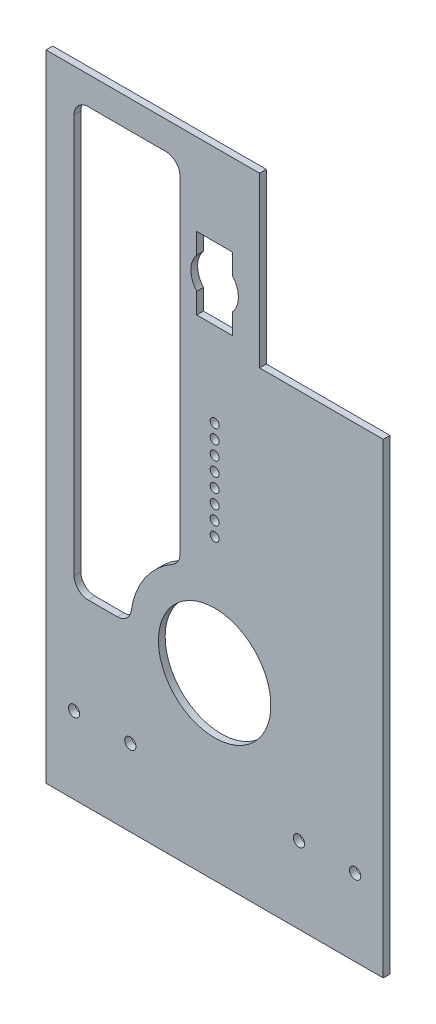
ISO-10303-21;
HEADER;
FILE_DESCRIPTION(('STEP AP214'),'2;1');
FILE_NAME('part.step','',(''),(''),'','','');
FILE_SCHEMA(('AUTOMOTIVE_DESIGN { 1 0 10303 214 1 1 1 1 }'));
ENDSEC;
DATA;
#1=APPLICATION_CONTEXT('core data for automotive mechanical design processes');
#2=APPLICATION_PROTOCOL_DEFINITION('international standard','automotive_design',2000,#1);
#3=PRODUCT_CONTEXT('',#1,'mechanical');
#4=PRODUCT('Part','Part','',(#3));
#5=PRODUCT_RELATED_PRODUCT_CATEGORY('part','',(#4));
#6=PRODUCT_DEFINITION_FORMATION('','',#4);
#7=PRODUCT_DEFINITION_CONTEXT('part definition',#1,'design');
#8=PRODUCT_DEFINITION('design','',#6,#7);
#9=PRODUCT_DEFINITION_SHAPE('','',#8);
#10=(LENGTH_UNIT() NAMED_UNIT(*) SI_UNIT(.MILLI.,.METRE.));
#11=(NAMED_UNIT(*) PLANE_ANGLE_UNIT() SI_UNIT($,.RADIAN.));
#12=(NAMED_UNIT(*) SI_UNIT($,.STERADIAN.) SOLID_ANGLE_UNIT());
#13=UNCERTAINTY_MEASURE_WITH_UNIT(LENGTH_MEASURE(1.E-05),#10,'distance_accuracy_value','');
#14=(GEOMETRIC_REPRESENTATION_CONTEXT(3) GLOBAL_UNCERTAINTY_ASSIGNED_CONTEXT((#13)) GLOBAL_UNIT_ASSIGNED_CONTEXT((#10,
#11,#12)) REPRESENTATION_CONTEXT('',''));
#15=CARTESIAN_POINT('',(0.,0.,0.));
#16=DIRECTION('',(0.,0.,1.));
#17=DIRECTION('',(1.,0.,0.));
#18=AXIS2_PLACEMENT_3D('',#15,#16,#17);
#19=CARTESIAN_POINT('',(0.,0.,3.048));
#20=DIRECTION('',(0.,0.,1.));
#21=DIRECTION('',(1.,0.,0.));
#22=AXIS2_PLACEMENT_3D('',#19,#20,#21);
#23=PLANE('',#22);
#24=DIRECTION('',(1.,0.,0.));
#25=VECTOR('',#24,1.);
#26=CARTESIAN_POINT('',(76.2,-140.97,3.048));
#27=LINE('',#26,#25);
#28=CARTESIAN_POINT('',(-76.2,-140.97,3.048));
#29=VERTEX_POINT('',#28);
#30=CARTESIAN_POINT('',(76.2,-140.97,3.048));
#31=VERTEX_POINT('',#30);
#32=EDGE_CURVE('E246',#29,#31,#27,.T.);
#33=ORIENTED_EDGE('',*,*,#32,.T.);
#34=DIRECTION('',(0.,1.,0.));
#35=VECTOR('',#34,1.);
#36=CARTESIAN_POINT('',(76.2,146.05,3.048));
#37=LINE('',#36,#35);
#38=CARTESIAN_POINT('',(76.2,69.85,3.048));
#39=VERTEX_POINT('',#38);
#40=EDGE_CURVE('E261',#31,#39,#37,.T.);
#41=ORIENTED_EDGE('',*,*,#40,.T.);
#42=DIRECTION('',(1.,0.,0.));
#43=VECTOR('',#42,1.);
#44=CARTESIAN_POINT('',(76.2,69.85,3.048));
#45=LINE('',#44,#43);
#46=CARTESIAN_POINT('',(20.32,69.85,3.048));
#47=VERTEX_POINT('',#46);
#48=EDGE_CURVE('E428',#47,#39,#45,.T.);
#49=ORIENTED_EDGE('',*,*,#48,.F.);
#50=DIRECTION('',(0.,-1.,0.));
#51=VECTOR('',#50,1.);
#52=CARTESIAN_POINT('',(20.32,146.05,3.048));
#53=LINE('',#52,#51);
#54=CARTESIAN_POINT('',(20.32,146.05,3.048));
#55=VERTEX_POINT('',#54);
#56=EDGE_CURVE('E425',#55,#47,#53,.T.);
#57=ORIENTED_EDGE('',*,*,#56,.F.);
#58=DIRECTION('',(-1.,0.,0.));
#59=VECTOR('',#58,1.);
#60=CARTESIAN_POINT('',(-76.2,146.05,3.048));
#61=LINE('',#60,#59);
#62=CARTESIAN_POINT('',(-76.2,146.05,3.048));
#63=VERTEX_POINT('',#62);
#64=EDGE_CURVE('E272',#55,#63,#61,.T.);
#65=ORIENTED_EDGE('',*,*,#64,.T.);
#66=DIRECTION('',(0.,-1.,0.));
#67=VECTOR('',#66,1.);
#68=CARTESIAN_POINT('',(-76.2,146.05,3.048));
#69=LINE('',#68,#67);
#70=EDGE_CURVE('E264',#63,#29,#69,.T.);
#71=ORIENTED_EDGE('',*,*,#70,.T.);
#72=EDGE_LOOP('',(#33,#41,#49,#57,#65,#71));
#73=FACE_BOUND('',#72,.T.);
#74=CARTESIAN_POINT('',(63.5,-106.299,3.048));
#75=DIRECTION('',(0.,0.,-1.));
#76=DIRECTION('',(-1.,0.,0.));
#77=AXIS2_PLACEMENT_3D('',#74,#75,#76);
#78=CIRCLE('',#77,2.54000000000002);
#79=CARTESIAN_POINT('',(60.96,-106.299,3.048));
#80=VERTEX_POINT('',#79);
#81=EDGE_CURVE('E401',#80,#80,#78,.T.);
#82=ORIENTED_EDGE('',*,*,#81,.T.);
#83=EDGE_LOOP('',(#82));
#84=FACE_BOUND('',#83,.T.);
#85=CARTESIAN_POINT('',(-63.5,-106.299,3.048));
#86=DIRECTION('',(0.,0.,-1.));
#87=DIRECTION('',(1.,0.,0.));
#88=AXIS2_PLACEMENT_3D('',#85,#86,#87);
#89=CIRCLE('',#88,2.54000000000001);
#90=CARTESIAN_POINT('',(-66.04,-106.299,3.048));
#91=VERTEX_POINT('',#90);
#92=EDGE_CURVE('E410',#91,#91,#89,.T.);
#93=ORIENTED_EDGE('',*,*,#92,.T.);
#94=EDGE_LOOP('',(#93));
#95=FACE_BOUND('',#94,.T.);
#96=CARTESIAN_POINT('',(-38.1,-106.299,3.048));
#97=DIRECTION('',(0.,0.,-1.));
#98=DIRECTION('',(1.,0.,0.));
#99=AXIS2_PLACEMENT_3D('',#96,#97,#98);
#100=CIRCLE('',#99,2.54);
#101=CARTESIAN_POINT('',(-40.64,-106.299,3.048));
#102=VERTEX_POINT('',#101);
#103=EDGE_CURVE('E393',#102,#102,#100,.T.);
#104=ORIENTED_EDGE('',*,*,#103,.T.);
#105=EDGE_LOOP('',(#104));
#106=FACE_BOUND('',#105,.T.);
#107=CARTESIAN_POINT('',(38.1,-106.299,3.048));
#108=DIRECTION('',(0.,0.,-1.));
#109=DIRECTION('',(-1.,0.,0.));
#110=AXIS2_PLACEMENT_3D('',#107,#108,#109);
#111=CIRCLE('',#110,2.54);
#112=CARTESIAN_POINT('',(35.56,-106.299,3.048));
#113=VERTEX_POINT('',#112);
#114=EDGE_CURVE('E417',#113,#113,#111,.T.);
#115=ORIENTED_EDGE('',*,*,#114,.T.);
#116=EDGE_LOOP('',(#115));
#117=FACE_BOUND('',#116,.T.);
#118=CARTESIAN_POINT('',(1.56751646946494E-13,31.75,3.048));
#119=DIRECTION('',(0.,0.,1.));
#120=DIRECTION('',(1.,0.,0.));
#121=AXIS2_PLACEMENT_3D('',#118,#119,#120);
#122=CIRCLE('',#121,2.0193);
#123=CARTESIAN_POINT('',(-2.01929999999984,31.75,3.048));
#124=VERTEX_POINT('',#123);
#125=EDGE_CURVE('E291',#124,#124,#122,.T.);
#126=ORIENTED_EDGE('',*,*,#125,.F.);
#127=EDGE_LOOP('',(#126));
#128=FACE_BOUND('',#127,.T.);
#129=CARTESIAN_POINT('',(0.,38.1,3.048));
#130=DIRECTION('',(0.,0.,1.));
#131=DIRECTION('',(1.,0.,0.));
#132=AXIS2_PLACEMENT_3D('',#129,#130,#131);
#133=CIRCLE('',#132,2.0193);
#134=CARTESIAN_POINT('',(-2.0193,38.1,3.048));
#135=VERTEX_POINT('',#134);
#136=EDGE_CURVE('E452',#135,#135,#133,.T.);
#137=ORIENTED_EDGE('',*,*,#136,.F.);
#138=EDGE_LOOP('',(#137));
#139=FACE_BOUND('',#138,.T.);
#140=CARTESIAN_POINT('',(3.13503293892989E-13,25.4,3.048));
#141=DIRECTION('',(0.,0.,1.));
#142=DIRECTION('',(1.,0.,0.));
#143=AXIS2_PLACEMENT_3D('',#140,#141,#142);
#144=CIRCLE('',#143,2.0193);
#145=CARTESIAN_POINT('',(-2.01929999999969,25.4,3.048));
#146=VERTEX_POINT('',#145);
#147=EDGE_CURVE('E460',#146,#146,#144,.T.);
#148=ORIENTED_EDGE('',*,*,#147,.F.);
#149=EDGE_LOOP('',(#148));
#150=FACE_BOUND('',#149,.T.);
#151=CARTESIAN_POINT('',(4.70254940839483E-13,19.05,3.048));
#152=DIRECTION('',(0.,0.,1.));
#153=DIRECTION('',(1.,0.,0.));
#154=AXIS2_PLACEMENT_3D('',#151,#152,#153);
#155=CIRCLE('',#154,2.0193);
#156=CARTESIAN_POINT('',(-2.01929999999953,19.05,3.048));
#157=VERTEX_POINT('',#156);
#158=EDGE_CURVE('E468',#157,#157,#155,.T.);
#159=ORIENTED_EDGE('',*,*,#158,.F.);
#160=EDGE_LOOP('',(#159));
#161=FACE_BOUND('',#160,.T.);
#162=CARTESIAN_POINT('',(6.27006587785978E-13,12.7,3.048));
#163=DIRECTION('',(0.,0.,1.));
#164=DIRECTION('',(1.,0.,0.));
#165=AXIS2_PLACEMENT_3D('',#162,#163,#164);
#166=CIRCLE('',#165,2.0193);
#167=CARTESIAN_POINT('',(-2.01929999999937,12.7,3.048));
#168=VERTEX_POINT('',#167);
#169=EDGE_CURVE('E476',#168,#168,#166,.T.);
#170=ORIENTED_EDGE('',*,*,#169,.F.);
#171=EDGE_LOOP('',(#170));
#172=FACE_BOUND('',#171,.T.);
#173=CARTESIAN_POINT('',(7.83758234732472E-13,6.35,3.048));
#174=DIRECTION('',(0.,0.,1.));
#175=DIRECTION('',(1.,0.,0.));
#176=AXIS2_PLACEMENT_3D('',#173,#174,#175);
#177=CIRCLE('',#176,2.0193);
#178=CARTESIAN_POINT('',(-2.01929999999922,6.35,3.048));
#179=VERTEX_POINT('',#178);
#180=EDGE_CURVE('E484',#179,#179,#177,.T.);
#181=ORIENTED_EDGE('',*,*,#180,.F.);
#182=EDGE_LOOP('',(#181));
#183=FACE_BOUND('',#182,.T.);
#184=CARTESIAN_POINT('',(9.40509881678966E-13,0.,3.048));
#185=DIRECTION('',(0.,0.,1.));
#186=DIRECTION('',(1.,0.,0.));
#187=AXIS2_PLACEMENT_3D('',#184,#185,#186);
#188=CIRCLE('',#187,2.0193);
#189=CARTESIAN_POINT('',(-2.01929999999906,0.,3.048));
#190=VERTEX_POINT('',#189);
#191=EDGE_CURVE('E492',#190,#190,#188,.T.);
#192=ORIENTED_EDGE('',*,*,#191,.F.);
#193=EDGE_LOOP('',(#192));
#194=FACE_BOUND('',#193,.T.);
#195=CARTESIAN_POINT('',(1.09726152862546E-12,-6.34999999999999,3.048));
#196=DIRECTION('',(0.,0.,1.));
#197=DIRECTION('',(1.,0.,0.));
#198=AXIS2_PLACEMENT_3D('',#195,#196,#197);
#199=CIRCLE('',#198,2.0193);
#200=CARTESIAN_POINT('',(-2.0192999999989,-6.34999999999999,3.048));
#201=VERTEX_POINT('',#200);
#202=EDGE_CURVE('E500',#201,#201,#199,.T.);
#203=ORIENTED_EDGE('',*,*,#202,.F.);
#204=EDGE_LOOP('',(#203));
#205=FACE_BOUND('',#204,.T.);
#206=CARTESIAN_POINT('',(0.,-59.69,3.048));
#207=DIRECTION('',(0.,0.,1.));
#208=DIRECTION('',(1.,0.,0.));
#209=AXIS2_PLACEMENT_3D('',#206,#207,#208);
#210=CIRCLE('',#209,25.4);
#211=CARTESIAN_POINT('',(-25.4,-59.69,3.048));
#212=VERTEX_POINT('',#211);
#213=EDGE_CURVE('E508',#212,#212,#210,.T.);
#214=ORIENTED_EDGE('',*,*,#213,.F.);
#215=EDGE_LOOP('',(#214));
#216=FACE_BOUND('',#215,.T.);
#217=DIRECTION('',(0.,-1.,0.));
#218=VECTOR('',#217,1.);
#219=CARTESIAN_POINT('',(8.08689428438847,109.0549,3.048));
#220=LINE('',#219,#218);
#221=CARTESIAN_POINT('',(8.08689428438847,109.0549,3.048));
#222=VERTEX_POINT('',#221);
#223=CARTESIAN_POINT('',(8.08689428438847,99.764589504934,3.048));
#224=VERTEX_POINT('',#223);
#225=EDGE_CURVE('E571',#222,#224,#220,.T.);
#226=ORIENTED_EDGE('',*,*,#225,.T.);
#227=CARTESIAN_POINT('',(0.,92.71,3.048));
#228=DIRECTION('',(0.,0.,1.));
#229=DIRECTION('',(1.,0.,0.));
#230=AXIS2_PLACEMENT_3D('',#227,#228,#229);
#231=CIRCLE('',#230,10.7315);
#232=CARTESIAN_POINT('',(8.08689428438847,85.655410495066,3.048));
#233=VERTEX_POINT('',#232);
#234=EDGE_CURVE('E524',#233,#224,#231,.T.);
#235=ORIENTED_EDGE('',*,*,#234,.F.);
#236=CARTESIAN_POINT('',(8.08689428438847,76.3651,3.048));
#237=VERTEX_POINT('',#236);
#238=EDGE_CURVE('E548',#233,#237,#220,.T.);
#239=ORIENTED_EDGE('',*,*,#238,.T.);
#240=DIRECTION('',(-1.,0.,0.));
#241=VECTOR('',#240,1.);
#242=CARTESIAN_POINT('',(8.08689428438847,76.3651,3.048));
#243=LINE('',#242,#241);
#244=CARTESIAN_POINT('',(-8.08689428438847,76.3651,3.048));
#245=VERTEX_POINT('',#244);
#246=EDGE_CURVE('E567',#237,#245,#243,.T.);
#247=ORIENTED_EDGE('',*,*,#246,.T.);
#248=DIRECTION('',(0.,-1.,0.));
#249=VECTOR('',#248,1.);
#250=CARTESIAN_POINT('',(-8.08689428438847,109.0549,3.048));
#251=LINE('',#250,#249);
#252=CARTESIAN_POINT('',(-8.08689428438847,85.655410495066,3.048));
#253=VERTEX_POINT('',#252);
#254=EDGE_CURVE('E566',#253,#245,#251,.T.);
#255=ORIENTED_EDGE('',*,*,#254,.F.);
#256=CARTESIAN_POINT('',(0.,92.71,3.048));
#257=DIRECTION('',(0.,0.,1.));
#258=DIRECTION('',(1.,0.,0.));
#259=AXIS2_PLACEMENT_3D('',#256,#257,#258);
#260=CIRCLE('',#259,10.7315);
#261=CARTESIAN_POINT('',(-8.08689428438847,99.764589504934,3.048));
#262=VERTEX_POINT('',#261);
#263=EDGE_CURVE('E580',#262,#253,#260,.T.);
#264=ORIENTED_EDGE('',*,*,#263,.F.);
#265=CARTESIAN_POINT('',(-8.08689428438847,109.0549,3.048));
#266=VERTEX_POINT('',#265);
#267=EDGE_CURVE('E562',#266,#262,#251,.T.);
#268=ORIENTED_EDGE('',*,*,#267,.F.);
#269=DIRECTION('',(-1.,0.,0.));
#270=VECTOR('',#269,1.);
#271=CARTESIAN_POINT('',(8.08689428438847,109.0549,3.048));
#272=LINE('',#271,#270);
#273=EDGE_CURVE('E533',#222,#266,#272,.T.);
#274=ORIENTED_EDGE('',*,*,#273,.F.);
#275=EDGE_LOOP('',(#226,#235,#239,#247,#255,#264,#268,#274));
#276=FACE_BOUND('',#275,.T.);
#277=DIRECTION('',(0.,1.,0.));
#278=VECTOR('',#277,1.);
#279=CARTESIAN_POINT('',(-15.671209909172,0.,3.048));
#280=LINE('',#279,#278);
#281=CARTESIAN_POINT('',(-15.671209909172,-21.0782295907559,3.048));
#282=VERTEX_POINT('',#281);
#283=CARTESIAN_POINT('',(-15.671209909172,127.,3.048));
#284=VERTEX_POINT('',#283);
#285=EDGE_CURVE('E372',#282,#284,#280,.T.);
#286=ORIENTED_EDGE('',*,*,#285,.F.);
#287=CARTESIAN_POINT('',(-22.021209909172,-21.0782295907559,3.048));
#288=DIRECTION('',(0.,0.,1.));
#289=DIRECTION('',(1.,0.,0.));
#290=AXIS2_PLACEMENT_3D('',#287,#288,#289);
#291=CIRCLE('',#290,6.35);
#292=CARTESIAN_POINT('',(-18.8753227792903,-26.5941967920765,3.048));
#293=VERTEX_POINT('',#292);
#294=EDGE_CURVE('E340',#282,#293,#291,.F.);
#295=ORIENTED_EDGE('',*,*,#294,.T.);
#296=CARTESIAN_POINT('',(0.,-59.69,3.048));
#297=DIRECTION('',(0.,0.,1.));
#298=DIRECTION('',(1.,0.,0.));
#299=AXIS2_PLACEMENT_3D('',#296,#297,#298);
#300=CIRCLE('',#299,38.1);
#301=CARTESIAN_POINT('',(-37.709220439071,-54.2471428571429,3.048));
#302=VERTEX_POINT('',#301);
#303=EDGE_CURVE('E379',#293,#302,#300,.T.);
#304=ORIENTED_EDGE('',*,*,#303,.T.);
#305=CARTESIAN_POINT('',(-43.9940905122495,-53.34,3.048));
#306=DIRECTION('',(0.,0.,1.));
#307=DIRECTION('',(1.,0.,0.));
#308=AXIS2_PLACEMENT_3D('',#305,#306,#307);
#309=CIRCLE('',#308,6.35);
#310=CARTESIAN_POINT('',(-43.9940905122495,-59.69,3.048));
#311=VERTEX_POINT('',#310);
#312=EDGE_CURVE('E334',#302,#311,#309,.F.);
#313=ORIENTED_EDGE('',*,*,#312,.T.);
#314=DIRECTION('',(1.,0.,0.));
#315=VECTOR('',#314,1.);
#316=CARTESIAN_POINT('',(0.,-59.69,3.048));
#317=LINE('',#316,#315);
#318=CARTESIAN_POINT('',(-57.15,-59.69,3.048));
#319=VERTEX_POINT('',#318);
#320=EDGE_CURVE('E660',#319,#311,#317,.T.);
#321=ORIENTED_EDGE('',*,*,#320,.F.);
#322=CARTESIAN_POINT('',(-57.15,-53.34,3.048));
#323=DIRECTION('',(0.,0.,1.));
#324=DIRECTION('',(1.,0.,0.));
#325=AXIS2_PLACEMENT_3D('',#322,#323,#324);
#326=CIRCLE('',#325,6.35);
#327=CARTESIAN_POINT('',(-63.5,-53.34,3.048));
#328=VERTEX_POINT('',#327);
#329=EDGE_CURVE('E346',#319,#328,#326,.F.);
#330=ORIENTED_EDGE('',*,*,#329,.T.);
#331=DIRECTION('',(0.,1.,0.));
#332=VECTOR('',#331,1.);
#333=CARTESIAN_POINT('',(-63.5,0.,3.048));
#334=LINE('',#333,#332);
#335=CARTESIAN_POINT('',(-63.5,127.,3.048));
#336=VERTEX_POINT('',#335);
#337=EDGE_CURVE('E385',#328,#336,#334,.T.);
#338=ORIENTED_EDGE('',*,*,#337,.T.);
#339=CARTESIAN_POINT('',(-57.15,127.,3.048));
#340=DIRECTION('',(0.,0.,1.));
#341=DIRECTION('',(1.,0.,0.));
#342=AXIS2_PLACEMENT_3D('',#339,#340,#341);
#343=CIRCLE('',#342,6.35);
#344=CARTESIAN_POINT('',(-57.15,133.35,3.048));
#345=VERTEX_POINT('',#344);
#346=EDGE_CURVE('E104',#336,#345,#343,.F.);
#347=ORIENTED_EDGE('',*,*,#346,.T.);
#348=DIRECTION('',(1.,0.,0.));
#349=VECTOR('',#348,1.);
#350=CARTESIAN_POINT('',(0.,133.35,3.048));
#351=LINE('',#350,#349);
#352=CARTESIAN_POINT('',(-22.021209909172,133.35,3.048));
#353=VERTEX_POINT('',#352);
#354=EDGE_CURVE('E374',#345,#353,#351,.T.);
#355=ORIENTED_EDGE('',*,*,#354,.T.);
#356=CARTESIAN_POINT('',(-22.021209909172,127.,3.048));
#357=DIRECTION('',(0.,0.,1.));
#358=DIRECTION('',(1.,0.,0.));
#359=AXIS2_PLACEMENT_3D('',#356,#357,#358);
#360=CIRCLE('',#359,6.35);
#361=EDGE_CURVE('E12',#353,#284,#360,.F.);
#362=ORIENTED_EDGE('',*,*,#361,.T.);
#363=EDGE_LOOP('',(#286,#295,#304,#313,#321,#330,#338,#347,#355,#362));
#364=FACE_BOUND('',#363,.T.);
#365=ADVANCED_FACE('F81',(#73,#84,#95,#106,#117,#128,#139,#150,#161,#172,#183,#194,#205,#216,
#276,#364),#23,.T.);
#366=CARTESIAN_POINT('',(0.,0.,0.));
#367=DIRECTION('',(0.,0.,1.));
#368=DIRECTION('',(1.,0.,0.));
#369=AXIS2_PLACEMENT_3D('',#366,#367,#368);
#370=PLANE('',#369);
#371=DIRECTION('',(0.,1.,0.));
#372=VECTOR('',#371,1.);
#373=CARTESIAN_POINT('',(76.2,146.05,0.));
#374=LINE('',#373,#372);
#375=CARTESIAN_POINT('',(76.2,-140.97,0.));
#376=VERTEX_POINT('',#375);
#377=CARTESIAN_POINT('',(76.2,69.85,0.));
#378=VERTEX_POINT('',#377);
#379=EDGE_CURVE('E288',#376,#378,#374,.T.);
#380=ORIENTED_EDGE('',*,*,#379,.F.);
#381=DIRECTION('',(1.,0.,0.));
#382=VECTOR('',#381,1.);
#383=CARTESIAN_POINT('',(76.2,-140.97,0.));
#384=LINE('',#383,#382);
#385=CARTESIAN_POINT('',(-76.2,-140.97,0.));
#386=VERTEX_POINT('',#385);
#387=EDGE_CURVE('E249',#386,#376,#384,.T.);
#388=ORIENTED_EDGE('',*,*,#387,.F.);
#389=DIRECTION('',(0.,-1.,0.));
#390=VECTOR('',#389,1.);
#391=CARTESIAN_POINT('',(-76.2,146.05,0.));
#392=LINE('',#391,#390);
#393=CARTESIAN_POINT('',(-76.2,146.05,0.));
#394=VERTEX_POINT('',#393);
#395=EDGE_CURVE('E273',#394,#386,#392,.T.);
#396=ORIENTED_EDGE('',*,*,#395,.F.);
#397=DIRECTION('',(-1.,0.,0.));
#398=VECTOR('',#397,1.);
#399=CARTESIAN_POINT('',(-76.2,146.05,0.));
#400=LINE('',#399,#398);
#401=CARTESIAN_POINT('',(20.32,146.05,0.));
#402=VERTEX_POINT('',#401);
#403=EDGE_CURVE('E279',#402,#394,#400,.T.);
#404=ORIENTED_EDGE('',*,*,#403,.F.);
#405=DIRECTION('',(0.,-1.,0.));
#406=VECTOR('',#405,1.);
#407=CARTESIAN_POINT('',(20.32,146.05,0.));
#408=LINE('',#407,#406);
#409=CARTESIAN_POINT('',(20.32,69.85,0.));
#410=VERTEX_POINT('',#409);
#411=EDGE_CURVE('E421',#402,#410,#408,.T.);
#412=ORIENTED_EDGE('',*,*,#411,.T.);
#413=DIRECTION('',(1.,0.,0.));
#414=VECTOR('',#413,1.);
#415=CARTESIAN_POINT('',(76.2,69.85,0.));
#416=LINE('',#415,#414);
#417=EDGE_CURVE('E429',#410,#378,#416,.T.);
#418=ORIENTED_EDGE('',*,*,#417,.T.);
#419=EDGE_LOOP('',(#380,#388,#396,#404,#412,#418));
#420=FACE_BOUND('',#419,.T.);
#421=CARTESIAN_POINT('',(0.,-59.69,0.));
#422=DIRECTION('',(0.,0.,1.));
#423=DIRECTION('',(1.,0.,0.));
#424=AXIS2_PLACEMENT_3D('',#421,#422,#423);
#425=CIRCLE('',#424,25.4);
#426=CARTESIAN_POINT('',(-25.4,-59.69,0.));
#427=VERTEX_POINT('',#426);
#428=EDGE_CURVE('E504',#427,#427,#425,.T.);
#429=ORIENTED_EDGE('',*,*,#428,.T.);
#430=EDGE_LOOP('',(#429));
#431=FACE_BOUND('',#430,.T.);
#432=CARTESIAN_POINT('',(1.09726152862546E-12,-6.34999999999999,0.));
#433=DIRECTION('',(0.,0.,1.));
#434=DIRECTION('',(1.,0.,0.));
#435=AXIS2_PLACEMENT_3D('',#432,#433,#434);
#436=CIRCLE('',#435,2.0193);
#437=CARTESIAN_POINT('',(-2.0192999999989,-6.34999999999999,0.));
#438=VERTEX_POINT('',#437);
#439=EDGE_CURVE('E496',#438,#438,#436,.T.);
#440=ORIENTED_EDGE('',*,*,#439,.T.);
#441=EDGE_LOOP('',(#440));
#442=FACE_BOUND('',#441,.T.);
#443=CARTESIAN_POINT('',(9.40509881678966E-13,0.,0.));
#444=DIRECTION('',(0.,0.,1.));
#445=DIRECTION('',(1.,0.,0.));
#446=AXIS2_PLACEMENT_3D('',#443,#444,#445);
#447=CIRCLE('',#446,2.0193);
#448=CARTESIAN_POINT('',(-2.01929999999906,0.,0.));
#449=VERTEX_POINT('',#448);
#450=EDGE_CURVE('E488',#449,#449,#447,.T.);
#451=ORIENTED_EDGE('',*,*,#450,.T.);
#452=EDGE_LOOP('',(#451));
#453=FACE_BOUND('',#452,.T.);
#454=CARTESIAN_POINT('',(7.83758234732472E-13,6.35,0.));
#455=DIRECTION('',(0.,0.,1.));
#456=DIRECTION('',(1.,0.,0.));
#457=AXIS2_PLACEMENT_3D('',#454,#455,#456);
#458=CIRCLE('',#457,2.0193);
#459=CARTESIAN_POINT('',(-2.01929999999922,6.35,0.));
#460=VERTEX_POINT('',#459);
#461=EDGE_CURVE('E480',#460,#460,#458,.T.);
#462=ORIENTED_EDGE('',*,*,#461,.T.);
#463=EDGE_LOOP('',(#462));
#464=FACE_BOUND('',#463,.T.);
#465=CARTESIAN_POINT('',(6.27006587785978E-13,12.7,0.));
#466=DIRECTION('',(0.,0.,1.));
#467=DIRECTION('',(1.,0.,0.));
#468=AXIS2_PLACEMENT_3D('',#465,#466,#467);
#469=CIRCLE('',#468,2.0193);
#470=CARTESIAN_POINT('',(-2.01929999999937,12.7,0.));
#471=VERTEX_POINT('',#470);
#472=EDGE_CURVE('E472',#471,#471,#469,.T.);
#473=ORIENTED_EDGE('',*,*,#472,.T.);
#474=EDGE_LOOP('',(#473));
#475=FACE_BOUND('',#474,.T.);
#476=CARTESIAN_POINT('',(4.70254940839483E-13,19.05,0.));
#477=DIRECTION('',(0.,0.,1.));
#478=DIRECTION('',(1.,0.,0.));
#479=AXIS2_PLACEMENT_3D('',#476,#477,#478);
#480=CIRCLE('',#479,2.0193);
#481=CARTESIAN_POINT('',(-2.01929999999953,19.05,0.));
#482=VERTEX_POINT('',#481);
#483=EDGE_CURVE('E464',#482,#482,#480,.T.);
#484=ORIENTED_EDGE('',*,*,#483,.T.);
#485=EDGE_LOOP('',(#484));
#486=FACE_BOUND('',#485,.T.);
#487=CARTESIAN_POINT('',(3.13503293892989E-13,25.4,0.));
#488=DIRECTION('',(0.,0.,1.));
#489=DIRECTION('',(1.,0.,0.));
#490=AXIS2_PLACEMENT_3D('',#487,#488,#489);
#491=CIRCLE('',#490,2.0193);
#492=CARTESIAN_POINT('',(-2.01929999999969,25.4,0.));
#493=VERTEX_POINT('',#492);
#494=EDGE_CURVE('E456',#493,#493,#491,.T.);
#495=ORIENTED_EDGE('',*,*,#494,.T.);
#496=EDGE_LOOP('',(#495));
#497=FACE_BOUND('',#496,.T.);
#498=CARTESIAN_POINT('',(0.,38.1,0.));
#499=DIRECTION('',(0.,0.,1.));
#500=DIRECTION('',(1.,0.,0.));
#501=AXIS2_PLACEMENT_3D('',#498,#499,#500);
#502=CIRCLE('',#501,2.0193);
#503=CARTESIAN_POINT('',(-2.0193,38.1,0.));
#504=VERTEX_POINT('',#503);
#505=EDGE_CURVE('E448',#504,#504,#502,.T.);
#506=ORIENTED_EDGE('',*,*,#505,.T.);
#507=EDGE_LOOP('',(#506));
#508=FACE_BOUND('',#507,.T.);
#509=CARTESIAN_POINT('',(1.56751646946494E-13,31.75,0.));
#510=DIRECTION('',(0.,0.,1.));
#511=DIRECTION('',(1.,0.,0.));
#512=AXIS2_PLACEMENT_3D('',#509,#510,#511);
#513=CIRCLE('',#512,2.0193);
#514=CARTESIAN_POINT('',(-2.01929999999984,31.75,0.));
#515=VERTEX_POINT('',#514);
#516=EDGE_CURVE('E282',#515,#515,#513,.T.);
#517=ORIENTED_EDGE('',*,*,#516,.T.);
#518=EDGE_LOOP('',(#517));
#519=FACE_BOUND('',#518,.T.);
#520=CARTESIAN_POINT('',(0.,92.71,0.));
#521=DIRECTION('',(0.,0.,1.));
#522=DIRECTION('',(1.,0.,0.));
#523=AXIS2_PLACEMENT_3D('',#520,#521,#522);
#524=CIRCLE('',#523,10.7315);
#525=CARTESIAN_POINT('',(8.08689428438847,85.655410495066,0.));
#526=VERTEX_POINT('',#525);
#527=CARTESIAN_POINT('',(8.08689428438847,99.764589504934,0.));
#528=VERTEX_POINT('',#527);
#529=EDGE_CURVE('E512',#526,#528,#524,.T.);
#530=ORIENTED_EDGE('',*,*,#529,.T.);
#531=DIRECTION('',(0.,-1.,0.));
#532=VECTOR('',#531,1.);
#533=CARTESIAN_POINT('',(8.08689428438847,109.0549,0.));
#534=LINE('',#533,#532);
#535=CARTESIAN_POINT('',(8.08689428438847,109.0549,0.));
#536=VERTEX_POINT('',#535);
#537=EDGE_CURVE('E556',#536,#528,#534,.T.);
#538=ORIENTED_EDGE('',*,*,#537,.F.);
#539=DIRECTION('',(-1.,0.,0.));
#540=VECTOR('',#539,1.);
#541=CARTESIAN_POINT('',(8.08689428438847,109.0549,0.));
#542=LINE('',#541,#540);
#543=CARTESIAN_POINT('',(-8.08689428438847,109.0549,0.));
#544=VERTEX_POINT('',#543);
#545=EDGE_CURVE('E543',#536,#544,#542,.T.);
#546=ORIENTED_EDGE('',*,*,#545,.T.);
#547=DIRECTION('',(0.,-1.,0.));
#548=VECTOR('',#547,1.);
#549=CARTESIAN_POINT('',(-8.08689428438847,109.0549,0.));
#550=LINE('',#549,#548);
#551=CARTESIAN_POINT('',(-8.08689428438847,99.764589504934,0.));
#552=VERTEX_POINT('',#551);
#553=EDGE_CURVE('E547',#544,#552,#550,.T.);
#554=ORIENTED_EDGE('',*,*,#553,.T.);
#555=CARTESIAN_POINT('',(0.,92.71,0.));
#556=DIRECTION('',(0.,0.,1.));
#557=DIRECTION('',(1.,0.,0.));
#558=AXIS2_PLACEMENT_3D('',#555,#556,#557);
#559=CIRCLE('',#558,10.7315);
#560=CARTESIAN_POINT('',(-8.08689428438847,85.655410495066,0.));
#561=VERTEX_POINT('',#560);
#562=EDGE_CURVE('E517',#552,#561,#559,.T.);
#563=ORIENTED_EDGE('',*,*,#562,.T.);
#564=CARTESIAN_POINT('',(-8.08689428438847,76.3651,0.));
#565=VERTEX_POINT('',#564);
#566=EDGE_CURVE('E552',#561,#565,#550,.T.);
#567=ORIENTED_EDGE('',*,*,#566,.T.);
#568=DIRECTION('',(-1.,0.,0.));
#569=VECTOR('',#568,1.);
#570=CARTESIAN_POINT('',(8.08689428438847,76.3651,0.));
#571=LINE('',#570,#569);
#572=CARTESIAN_POINT('',(8.08689428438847,76.3651,0.));
#573=VERTEX_POINT('',#572);
#574=EDGE_CURVE('E553',#573,#565,#571,.T.);
#575=ORIENTED_EDGE('',*,*,#574,.F.);
#576=EDGE_CURVE('E528',#526,#573,#534,.T.);
#577=ORIENTED_EDGE('',*,*,#576,.F.);
#578=EDGE_LOOP('',(#530,#538,#546,#554,#563,#567,#575,#577));
#579=FACE_BOUND('',#578,.T.);
#580=CARTESIAN_POINT('',(38.1,-106.299,0.));
#581=DIRECTION('',(0.,0.,-1.));
#582=DIRECTION('',(-1.,0.,0.));
#583=AXIS2_PLACEMENT_3D('',#580,#581,#582);
#584=CIRCLE('',#583,2.54);
#585=CARTESIAN_POINT('',(35.56,-106.299,0.));
#586=VERTEX_POINT('',#585);
#587=EDGE_CURVE('E405',#586,#586,#584,.T.);
#588=ORIENTED_EDGE('',*,*,#587,.F.);
#589=EDGE_LOOP('',(#588));
#590=FACE_BOUND('',#589,.T.);
#591=CARTESIAN_POINT('',(-38.1,-106.299,0.));
#592=DIRECTION('',(0.,0.,-1.));
#593=DIRECTION('',(1.,0.,0.));
#594=AXIS2_PLACEMENT_3D('',#591,#592,#593);
#595=CIRCLE('',#594,2.54);
#596=CARTESIAN_POINT('',(-40.64,-106.299,0.));
#597=VERTEX_POINT('',#596);
#598=EDGE_CURVE('E254',#597,#597,#595,.T.);
#599=ORIENTED_EDGE('',*,*,#598,.F.);
#600=EDGE_LOOP('',(#599));
#601=FACE_BOUND('',#600,.T.);
#602=CARTESIAN_POINT('',(-63.5,-106.299,0.));
#603=DIRECTION('',(0.,0.,-1.));
#604=DIRECTION('',(1.,0.,0.));
#605=AXIS2_PLACEMENT_3D('',#602,#603,#604);
#606=CIRCLE('',#605,2.54000000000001);
#607=CARTESIAN_POINT('',(-66.04,-106.299,0.));
#608=VERTEX_POINT('',#607);
#609=EDGE_CURVE('E397',#608,#608,#606,.T.);
#610=ORIENTED_EDGE('',*,*,#609,.F.);
#611=EDGE_LOOP('',(#610));
#612=FACE_BOUND('',#611,.T.);
#613=CARTESIAN_POINT('',(63.5,-106.299,0.));
#614=DIRECTION('',(0.,0.,-1.));
#615=DIRECTION('',(-1.,0.,0.));
#616=AXIS2_PLACEMENT_3D('',#613,#614,#615);
#617=CIRCLE('',#616,2.54000000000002);
#618=CARTESIAN_POINT('',(60.96,-106.299,0.));
#619=VERTEX_POINT('',#618);
#620=EDGE_CURVE('E406',#619,#619,#617,.T.);
#621=ORIENTED_EDGE('',*,*,#620,.F.);
#622=EDGE_LOOP('',(#621));
#623=FACE_BOUND('',#622,.T.);
#624=DIRECTION('',(-1.,0.,0.));
#625=VECTOR('',#624,1.);
#626=CARTESIAN_POINT('',(0.,-59.69,0.));
#627=LINE('',#626,#625);
#628=CARTESIAN_POINT('',(-43.9940905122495,-59.69,0.));
#629=VERTEX_POINT('',#628);
#630=CARTESIAN_POINT('',(-57.15,-59.69,0.));
#631=VERTEX_POINT('',#630);
#632=EDGE_CURVE('E650',#629,#631,#627,.T.);
#633=ORIENTED_EDGE('',*,*,#632,.F.);
#634=CARTESIAN_POINT('',(-43.9940905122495,-53.34,0.));
#635=DIRECTION('',(0.,0.,1.));
#636=DIRECTION('',(1.,0.,0.));
#637=AXIS2_PLACEMENT_3D('',#634,#635,#636);
#638=CIRCLE('',#637,6.35);
#639=CARTESIAN_POINT('',(-37.709220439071,-54.2471428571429,0.));
#640=VERTEX_POINT('',#639);
#641=EDGE_CURVE('E331',#629,#640,#638,.T.);
#642=ORIENTED_EDGE('',*,*,#641,.T.);
#643=CARTESIAN_POINT('',(0.,-59.69,0.));
#644=DIRECTION('',(0.,0.,-1.));
#645=DIRECTION('',(-1.,0.,0.));
#646=AXIS2_PLACEMENT_3D('',#643,#644,#645);
#647=CIRCLE('',#646,38.1);
#648=CARTESIAN_POINT('',(-18.8753227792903,-26.5941967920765,0.));
#649=VERTEX_POINT('',#648);
#650=EDGE_CURVE('E654',#640,#649,#647,.T.);
#651=ORIENTED_EDGE('',*,*,#650,.T.);
#652=CARTESIAN_POINT('',(-22.021209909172,-21.0782295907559,0.));
#653=DIRECTION('',(0.,0.,1.));
#654=DIRECTION('',(1.,0.,0.));
#655=AXIS2_PLACEMENT_3D('',#652,#653,#654);
#656=CIRCLE('',#655,6.35);
#657=CARTESIAN_POINT('',(-15.671209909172,-21.0782295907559,0.));
#658=VERTEX_POINT('',#657);
#659=EDGE_CURVE('E337',#649,#658,#656,.T.);
#660=ORIENTED_EDGE('',*,*,#659,.T.);
#661=DIRECTION('',(0.,-1.,0.));
#662=VECTOR('',#661,1.);
#663=CARTESIAN_POINT('',(-15.671209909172,0.,0.));
#664=LINE('',#663,#662);
#665=CARTESIAN_POINT('',(-15.671209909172,127.,0.));
#666=VERTEX_POINT('',#665);
#667=EDGE_CURVE('E361',#666,#658,#664,.T.);
#668=ORIENTED_EDGE('',*,*,#667,.F.);
#669=CARTESIAN_POINT('',(-22.021209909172,127.,0.));
#670=DIRECTION('',(0.,0.,1.));
#671=DIRECTION('',(1.,0.,0.));
#672=AXIS2_PLACEMENT_3D('',#669,#670,#671);
#673=CIRCLE('',#672,6.35);
#674=CARTESIAN_POINT('',(-22.021209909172,133.35,0.));
#675=VERTEX_POINT('',#674);
#676=EDGE_CURVE('E90',#666,#675,#673,.T.);
#677=ORIENTED_EDGE('',*,*,#676,.T.);
#678=DIRECTION('',(-1.,0.,0.));
#679=VECTOR('',#678,1.);
#680=CARTESIAN_POINT('',(0.,133.35,0.));
#681=LINE('',#680,#679);
#682=CARTESIAN_POINT('',(-57.15,133.35,0.));
#683=VERTEX_POINT('',#682);
#684=EDGE_CURVE('E359',#675,#683,#681,.T.);
#685=ORIENTED_EDGE('',*,*,#684,.T.);
#686=CARTESIAN_POINT('',(-57.15,127.,0.));
#687=DIRECTION('',(0.,0.,1.));
#688=DIRECTION('',(1.,0.,0.));
#689=AXIS2_PLACEMENT_3D('',#686,#687,#688);
#690=CIRCLE('',#689,6.35);
#691=CARTESIAN_POINT('',(-63.5,127.,0.));
#692=VERTEX_POINT('',#691);
#693=EDGE_CURVE('E349',#683,#692,#690,.T.);
#694=ORIENTED_EDGE('',*,*,#693,.T.);
#695=DIRECTION('',(0.,-1.,0.));
#696=VECTOR('',#695,1.);
#697=CARTESIAN_POINT('',(-63.5,0.,0.));
#698=LINE('',#697,#696);
#699=CARTESIAN_POINT('',(-63.5,-53.34,0.));
#700=VERTEX_POINT('',#699);
#701=EDGE_CURVE('E367',#692,#700,#698,.T.);
#702=ORIENTED_EDGE('',*,*,#701,.T.);
#703=CARTESIAN_POINT('',(-57.15,-53.34,0.));
#704=DIRECTION('',(0.,0.,1.));
#705=DIRECTION('',(1.,0.,0.));
#706=AXIS2_PLACEMENT_3D('',#703,#704,#705);
#707=CIRCLE('',#706,6.35);
#708=EDGE_CURVE('E343',#700,#631,#707,.T.);
#709=ORIENTED_EDGE('',*,*,#708,.T.);
#710=EDGE_LOOP('',(#633,#642,#651,#660,#668,#677,#685,#694,#702,#709));
#711=FACE_BOUND('',#710,.T.);
#712=ADVANCED_FACE('F358',(#420,#431,#442,#453,#464,#475,#486,#497,#508,#519,#579,#590,#601,
#612,#623,#711),#370,.F.);
#713=CARTESIAN_POINT('',(76.2,146.05,3.048));
#714=DIRECTION('',(-1.,0.,0.));
#715=DIRECTION('',(0.,-1.,0.));
#716=AXIS2_PLACEMENT_3D('',#713,#714,#715);
#717=PLANE('',#716);
#718=ORIENTED_EDGE('',*,*,#40,.F.);
#719=DIRECTION('',(0.,0.,-1.));
#720=VECTOR('',#719,1.);
#721=CARTESIAN_POINT('',(76.2,-140.97,3.048));
#722=LINE('',#721,#720);
#723=EDGE_CURVE('E243',#31,#376,#722,.T.);
#724=ORIENTED_EDGE('',*,*,#723,.T.);
#725=ORIENTED_EDGE('',*,*,#379,.T.);
#726=DIRECTION('',(0.,0.,-1.));
#727=VECTOR('',#726,1.);
#728=CARTESIAN_POINT('',(76.2,69.85,3.048));
#729=LINE('',#728,#727);
#730=EDGE_CURVE('E270',#39,#378,#729,.T.);
#731=ORIENTED_EDGE('',*,*,#730,.F.);
#732=EDGE_LOOP('',(#718,#724,#725,#731));
#733=FACE_BOUND('',#732,.T.);
#734=ADVANCED_FACE('F268',(#733),#717,.F.);
#735=CARTESIAN_POINT('',(-76.2,146.05,3.048));
#736=DIRECTION('',(0.,-1.,0.));
#737=DIRECTION('',(0.,0.,-1.));
#738=AXIS2_PLACEMENT_3D('',#735,#736,#737);
#739=PLANE('',#738);
#740=DIRECTION('',(0.,0.,-1.));
#741=VECTOR('',#740,1.);
#742=CARTESIAN_POINT('',(20.32,146.05,3.048));
#743=LINE('',#742,#741);
#744=EDGE_CURVE('E443',#55,#402,#743,.T.);
#745=ORIENTED_EDGE('',*,*,#744,.T.);
#746=ORIENTED_EDGE('',*,*,#403,.T.);
#747=DIRECTION('',(0.,0.,-1.));
#748=VECTOR('',#747,1.);
#749=CARTESIAN_POINT('',(-76.2,146.05,3.048));
#750=LINE('',#749,#748);
#751=EDGE_CURVE('E287',#63,#394,#750,.T.);
#752=ORIENTED_EDGE('',*,*,#751,.F.);
#753=ORIENTED_EDGE('',*,*,#64,.F.);
#754=EDGE_LOOP('',(#745,#746,#752,#753));
#755=FACE_BOUND('',#754,.T.);
#756=ADVANCED_FACE('F607',(#755),#739,.F.);
#757=CARTESIAN_POINT('',(-76.2,146.05,3.048));
#758=DIRECTION('',(1.,0.,0.));
#759=DIRECTION('',(0.,1.,0.));
#760=AXIS2_PLACEMENT_3D('',#757,#758,#759);
#761=PLANE('',#760);
#762=ORIENTED_EDGE('',*,*,#395,.T.);
#763=DIRECTION('',(0.,0.,-1.));
#764=VECTOR('',#763,1.);
#765=CARTESIAN_POINT('',(-76.2,-140.97,3.048));
#766=LINE('',#765,#764);
#767=EDGE_CURVE('E255',#29,#386,#766,.T.);
#768=ORIENTED_EDGE('',*,*,#767,.F.);
#769=ORIENTED_EDGE('',*,*,#70,.F.);
#770=ORIENTED_EDGE('',*,*,#751,.T.);
#771=EDGE_LOOP('',(#762,#768,#769,#770));
#772=FACE_BOUND('',#771,.T.);
#773=ADVANCED_FACE('F598',(#772),#761,.F.);
#774=CARTESIAN_POINT('',(1.56751646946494E-13,31.75,3.048));
#775=DIRECTION('',(0.,0.,-1.));
#776=DIRECTION('',(-1.,0.,0.));
#777=AXIS2_PLACEMENT_3D('',#774,#775,#776);
#778=CYLINDRICAL_SURFACE('',#777,2.0193);
#779=CARTESIAN_POINT('',(-2.01929999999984,31.75,3.048));
#780=CARTESIAN_POINT('',(-2.01929999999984,31.75,3.01625));
#781=CARTESIAN_POINT('',(-2.01929999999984,31.75,2.9845));
#782=CARTESIAN_POINT('',(-2.01929999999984,31.75,2.921));
#783=CARTESIAN_POINT('',(-2.01929999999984,31.75,2.88925));
#784=CARTESIAN_POINT('',(-2.01929999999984,31.75,2.82575));
#785=CARTESIAN_POINT('',(-2.01929999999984,31.75,2.794));
#786=CARTESIAN_POINT('',(-2.01929999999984,31.75,2.7305));
#787=CARTESIAN_POINT('',(-2.01929999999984,31.75,2.69875));
#788=CARTESIAN_POINT('',(-2.01929999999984,31.75,2.63525));
#789=CARTESIAN_POINT('',(-2.01929999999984,31.75,2.6035));
#790=CARTESIAN_POINT('',(-2.01929999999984,31.75,2.54));
#791=CARTESIAN_POINT('',(-2.01929999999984,31.75,2.50825));
#792=CARTESIAN_POINT('',(-2.01929999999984,31.75,2.44475));
#793=CARTESIAN_POINT('',(-2.01929999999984,31.75,2.413));
#794=CARTESIAN_POINT('',(-2.01929999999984,31.75,2.3495));
#795=CARTESIAN_POINT('',(-2.01929999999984,31.75,2.31775));
#796=CARTESIAN_POINT('',(-2.01929999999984,31.75,2.25425));
#797=CARTESIAN_POINT('',(-2.01929999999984,31.75,2.2225));
#798=CARTESIAN_POINT('',(-2.01929999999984,31.75,2.159));
#799=CARTESIAN_POINT('',(-2.01929999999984,31.75,2.12725));
#800=CARTESIAN_POINT('',(-2.01929999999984,31.75,2.06375));
#801=CARTESIAN_POINT('',(-2.01929999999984,31.75,2.032));
#802=CARTESIAN_POINT('',(-2.01929999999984,31.75,1.9685));
#803=CARTESIAN_POINT('',(-2.01929999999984,31.75,1.93675));
#804=CARTESIAN_POINT('',(-2.01929999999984,31.75,1.87325));
#805=CARTESIAN_POINT('',(-2.01929999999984,31.75,1.8415));
#806=CARTESIAN_POINT('',(-2.01929999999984,31.75,1.778));
#807=CARTESIAN_POINT('',(-2.01929999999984,31.75,1.74625));
#808=CARTESIAN_POINT('',(-2.01929999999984,31.75,1.68275));
#809=CARTESIAN_POINT('',(-2.01929999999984,31.75,1.651));
#810=CARTESIAN_POINT('',(-2.01929999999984,31.75,1.5875));
#811=CARTESIAN_POINT('',(-2.01929999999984,31.75,1.55575));
#812=CARTESIAN_POINT('',(-2.01929999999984,31.75,1.49225));
#813=CARTESIAN_POINT('',(-2.01929999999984,31.75,1.4605));
#814=CARTESIAN_POINT('',(-2.01929999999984,31.75,1.397));
#815=CARTESIAN_POINT('',(-2.01929999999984,31.75,1.36525));
#816=CARTESIAN_POINT('',(-2.01929999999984,31.75,1.30175));
#817=CARTESIAN_POINT('',(-2.01929999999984,31.75,1.27));
#818=CARTESIAN_POINT('',(-2.01929999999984,31.75,1.2065));
#819=CARTESIAN_POINT('',(-2.01929999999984,31.75,1.17475));
#820=CARTESIAN_POINT('',(-2.01929999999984,31.75,1.11125));
#821=CARTESIAN_POINT('',(-2.01929999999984,31.75,1.0795));
#822=CARTESIAN_POINT('',(-2.01929999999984,31.75,1.016));
#823=CARTESIAN_POINT('',(-2.01929999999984,31.75,0.98425));
#824=CARTESIAN_POINT('',(-2.01929999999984,31.75,0.92075));
#825=CARTESIAN_POINT('',(-2.01929999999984,31.75,0.889));
#826=CARTESIAN_POINT('',(-2.01929999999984,31.75,0.8255));
#827=CARTESIAN_POINT('',(-2.01929999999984,31.75,0.79375));
#828=CARTESIAN_POINT('',(-2.01929999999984,31.75,0.73025));
#829=CARTESIAN_POINT('',(-2.01929999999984,31.75,0.6985));
#830=CARTESIAN_POINT('',(-2.01929999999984,31.75,0.635));
#831=CARTESIAN_POINT('',(-2.01929999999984,31.75,0.60325));
#832=CARTESIAN_POINT('',(-2.01929999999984,31.75,0.53975));
#833=CARTESIAN_POINT('',(-2.01929999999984,31.75,0.508));
#834=CARTESIAN_POINT('',(-2.01929999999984,31.75,0.4445));
#835=CARTESIAN_POINT('',(-2.01929999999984,31.75,0.41275));
#836=CARTESIAN_POINT('',(-2.01929999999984,31.75,0.34925));
#837=CARTESIAN_POINT('',(-2.01929999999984,31.75,0.3175));
#838=CARTESIAN_POINT('',(-2.01929999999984,31.75,0.254));
#839=CARTESIAN_POINT('',(-2.01929999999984,31.75,0.22225));
#840=CARTESIAN_POINT('',(-2.01929999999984,31.75,0.15875));
#841=CARTESIAN_POINT('',(-2.01929999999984,31.75,0.127));
#842=CARTESIAN_POINT('',(-2.01929999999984,31.75,0.0634999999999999));
#843=CARTESIAN_POINT('',(-2.01929999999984,31.75,0.03175));
#844=CARTESIAN_POINT('',(-2.01929999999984,31.75,0.));
#845=B_SPLINE_CURVE_WITH_KNOTS('',3,(#779,#780,#781,#782,#783,#784,#785,#786,#787,#788,#789,
#790,#791,#792,#793,#794,#795,#796,#797,#798,#799,#800,#801,#802,#803,#804,#805,#806,#807,#808,
#809,#810,#811,#812,#813,#814,#815,#816,#817,#818,#819,#820,#821,#822,#823,#824,#825,#826,#827,
#828,#829,#830,#831,#832,#833,#834,#835,#836,#837,#838,#839,#840,#841,#842,#843,#844),
.UNSPECIFIED.,.F.,.F.,(4,2,2,2,2,2,2,2,2,2,2,2,2,2,2,2,2,2,2,2,2,2,2,2,2,2,2,2,2,2,2,2,4),(0.,
0.0952500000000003,0.1905,0.28575,0.381,0.47625,0.5715,0.66675,0.762,0.85725,0.9525,1.04775,
1.143,1.23825,1.3335,1.42875,1.524,1.61925,1.7145,1.80975,1.905,2.00025,2.0955,2.19075,2.286,
2.38125,2.4765,2.57175,2.667,2.76225,2.8575,2.95275,3.048),.UNSPECIFIED.);
#846=EDGE_CURVE('BSEAM595',#124,#515,#845,.T.);
#847=ORIENTED_EDGE('',*,*,#125,.T.);
#848=ORIENTED_EDGE('',*,*,#516,.F.);
#849=ORIENTED_EDGE('',*,*,#846,.T.);
#850=ORIENTED_EDGE('',*,*,#846,.F.);
#851=EDGE_LOOP('',(#847,#849,#848,#850));
#852=FACE_BOUND('',#851,.T.);
#853=ADVANCED_FACE('F595',(#852),#778,.F.);
#854=CARTESIAN_POINT('',(0.,38.1,3.048));
#855=DIRECTION('',(0.,0.,-1.));
#856=DIRECTION('',(-1.,0.,0.));
#857=AXIS2_PLACEMENT_3D('',#854,#855,#856);
#858=CYLINDRICAL_SURFACE('',#857,2.0193);
#859=CARTESIAN_POINT('',(-2.0193,38.1,3.048));
#860=CARTESIAN_POINT('',(-2.0193,38.1,3.01625));
#861=CARTESIAN_POINT('',(-2.0193,38.1,2.9845));
#862=CARTESIAN_POINT('',(-2.0193,38.1,2.921));
#863=CARTESIAN_POINT('',(-2.0193,38.1,2.88925));
#864=CARTESIAN_POINT('',(-2.0193,38.1,2.82575));
#865=CARTESIAN_POINT('',(-2.0193,38.1,2.794));
#866=CARTESIAN_POINT('',(-2.0193,38.1,2.7305));
#867=CARTESIAN_POINT('',(-2.0193,38.1,2.69875));
#868=CARTESIAN_POINT('',(-2.0193,38.1,2.63525));
#869=CARTESIAN_POINT('',(-2.0193,38.1,2.6035));
#870=CARTESIAN_POINT('',(-2.0193,38.1,2.54));
#871=CARTESIAN_POINT('',(-2.0193,38.1,2.50825));
#872=CARTESIAN_POINT('',(-2.0193,38.1,2.44475));
#873=CARTESIAN_POINT('',(-2.0193,38.1,2.413));
#874=CARTESIAN_POINT('',(-2.0193,38.1,2.3495));
#875=CARTESIAN_POINT('',(-2.0193,38.1,2.31775));
#876=CARTESIAN_POINT('',(-2.0193,38.1,2.25425));
#877=CARTESIAN_POINT('',(-2.0193,38.1,2.2225));
#878=CARTESIAN_POINT('',(-2.0193,38.1,2.159));
#879=CARTESIAN_POINT('',(-2.0193,38.1,2.12725));
#880=CARTESIAN_POINT('',(-2.0193,38.1,2.06375));
#881=CARTESIAN_POINT('',(-2.0193,38.1,2.032));
#882=CARTESIAN_POINT('',(-2.0193,38.1,1.9685));
#883=CARTESIAN_POINT('',(-2.0193,38.1,1.93675));
#884=CARTESIAN_POINT('',(-2.0193,38.1,1.87325));
#885=CARTESIAN_POINT('',(-2.0193,38.1,1.8415));
#886=CARTESIAN_POINT('',(-2.0193,38.1,1.778));
#887=CARTESIAN_POINT('',(-2.0193,38.1,1.74625));
#888=CARTESIAN_POINT('',(-2.0193,38.1,1.68275));
#889=CARTESIAN_POINT('',(-2.0193,38.1,1.651));
#890=CARTESIAN_POINT('',(-2.0193,38.1,1.5875));
#891=CARTESIAN_POINT('',(-2.0193,38.1,1.55575));
#892=CARTESIAN_POINT('',(-2.0193,38.1,1.49225));
#893=CARTESIAN_POINT('',(-2.0193,38.1,1.4605));
#894=CARTESIAN_POINT('',(-2.0193,38.1,1.397));
#895=CARTESIAN_POINT('',(-2.0193,38.1,1.36525));
#896=CARTESIAN_POINT('',(-2.0193,38.1,1.30175));
#897=CARTESIAN_POINT('',(-2.0193,38.1,1.27));
#898=CARTESIAN_POINT('',(-2.0193,38.1,1.2065));
#899=CARTESIAN_POINT('',(-2.0193,38.1,1.17475));
#900=CARTESIAN_POINT('',(-2.0193,38.1,1.11125));
#901=CARTESIAN_POINT('',(-2.0193,38.1,1.0795));
#902=CARTESIAN_POINT('',(-2.0193,38.1,1.016));
#903=CARTESIAN_POINT('',(-2.0193,38.1,0.98425));
#904=CARTESIAN_POINT('',(-2.0193,38.1,0.92075));
#905=CARTESIAN_POINT('',(-2.0193,38.1,0.889));
#906=CARTESIAN_POINT('',(-2.0193,38.1,0.8255));
#907=CARTESIAN_POINT('',(-2.0193,38.1,0.79375));
#908=CARTESIAN_POINT('',(-2.0193,38.1,0.73025));
#909=CARTESIAN_POINT('',(-2.0193,38.1,0.6985));
#910=CARTESIAN_POINT('',(-2.0193,38.1,0.635));
#911=CARTESIAN_POINT('',(-2.0193,38.1,0.60325));
#912=CARTESIAN_POINT('',(-2.0193,38.1,0.53975));
#913=CARTESIAN_POINT('',(-2.0193,38.1,0.508));
#914=CARTESIAN_POINT('',(-2.0193,38.1,0.4445));
#915=CARTESIAN_POINT('',(-2.0193,38.1,0.41275));
#916=CARTESIAN_POINT('',(-2.0193,38.1,0.34925));
#917=CARTESIAN_POINT('',(-2.0193,38.1,0.3175));
#918=CARTESIAN_POINT('',(-2.0193,38.1,0.254));
#919=CARTESIAN_POINT('',(-2.0193,38.1,0.22225));
#920=CARTESIAN_POINT('',(-2.0193,38.1,0.15875));
#921=CARTESIAN_POINT('',(-2.0193,38.1,0.127));
#922=CARTESIAN_POINT('',(-2.0193,38.1,0.0634999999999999));
#923=CARTESIAN_POINT('',(-2.0193,38.1,0.03175));
#924=CARTESIAN_POINT('',(-2.0193,38.1,0.));
#925=B_SPLINE_CURVE_WITH_KNOTS('',3,(#859,#860,#861,#862,#863,#864,#865,#866,#867,#868,#869,
#870,#871,#872,#873,#874,#875,#876,#877,#878,#879,#880,#881,#882,#883,#884,#885,#886,#887,#888,
#889,#890,#891,#892,#893,#894,#895,#896,#897,#898,#899,#900,#901,#902,#903,#904,#905,#906,#907,
#908,#909,#910,#911,#912,#913,#914,#915,#916,#917,#918,#919,#920,#921,#922,#923,#924),
.UNSPECIFIED.,.F.,.F.,(4,2,2,2,2,2,2,2,2,2,2,2,2,2,2,2,2,2,2,2,2,2,2,2,2,2,2,2,2,2,2,2,4),(0.,
0.0952500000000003,0.1905,0.28575,0.381,0.47625,0.5715,0.66675,0.762,0.85725,0.9525,1.04775,
1.143,1.23825,1.3335,1.42875,1.524,1.61925,1.7145,1.80975,1.905,2.00025,2.0955,2.19075,2.286,
2.38125,2.4765,2.57175,2.667,2.76225,2.8575,2.95275,3.048),.UNSPECIFIED.);
#926=EDGE_CURVE('BSEAM597',#135,#504,#925,.T.);
#927=ORIENTED_EDGE('',*,*,#136,.T.);
#928=ORIENTED_EDGE('',*,*,#505,.F.);
#929=ORIENTED_EDGE('',*,*,#926,.T.);
#930=ORIENTED_EDGE('',*,*,#926,.F.);
#931=EDGE_LOOP('',(#927,#929,#928,#930));
#932=FACE_BOUND('',#931,.T.);
#933=ADVANCED_FACE('F597',(#932),#858,.F.);
#934=CARTESIAN_POINT('',(3.13503293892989E-13,25.4,3.048));
#935=DIRECTION('',(0.,0.,-1.));
#936=DIRECTION('',(-1.,0.,0.));
#937=AXIS2_PLACEMENT_3D('',#934,#935,#936);
#938=CYLINDRICAL_SURFACE('',#937,2.0193);
#939=CARTESIAN_POINT('',(-2.01929999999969,25.4,3.048));
#940=CARTESIAN_POINT('',(-2.01929999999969,25.4,3.01625));
#941=CARTESIAN_POINT('',(-2.01929999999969,25.4,2.9845));
#942=CARTESIAN_POINT('',(-2.01929999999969,25.4,2.921));
#943=CARTESIAN_POINT('',(-2.01929999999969,25.4,2.88925));
#944=CARTESIAN_POINT('',(-2.01929999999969,25.4,2.82575));
#945=CARTESIAN_POINT('',(-2.01929999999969,25.4,2.794));
#946=CARTESIAN_POINT('',(-2.01929999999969,25.4,2.7305));
#947=CARTESIAN_POINT('',(-2.01929999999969,25.4,2.69875));
#948=CARTESIAN_POINT('',(-2.01929999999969,25.4,2.63525));
#949=CARTESIAN_POINT('',(-2.01929999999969,25.4,2.6035));
#950=CARTESIAN_POINT('',(-2.01929999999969,25.4,2.54));
#951=CARTESIAN_POINT('',(-2.01929999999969,25.4,2.50825));
#952=CARTESIAN_POINT('',(-2.01929999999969,25.4,2.44475));
#953=CARTESIAN_POINT('',(-2.01929999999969,25.4,2.413));
#954=CARTESIAN_POINT('',(-2.01929999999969,25.4,2.3495));
#955=CARTESIAN_POINT('',(-2.01929999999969,25.4,2.31775));
#956=CARTESIAN_POINT('',(-2.01929999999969,25.4,2.25425));
#957=CARTESIAN_POINT('',(-2.01929999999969,25.4,2.2225));
#958=CARTESIAN_POINT('',(-2.01929999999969,25.4,2.159));
#959=CARTESIAN_POINT('',(-2.01929999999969,25.4,2.12725));
#960=CARTESIAN_POINT('',(-2.01929999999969,25.4,2.06375));
#961=CARTESIAN_POINT('',(-2.01929999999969,25.4,2.032));
#962=CARTESIAN_POINT('',(-2.01929999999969,25.4,1.9685));
#963=CARTESIAN_POINT('',(-2.01929999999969,25.4,1.93675));
#964=CARTESIAN_POINT('',(-2.01929999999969,25.4,1.87325));
#965=CARTESIAN_POINT('',(-2.01929999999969,25.4,1.8415));
#966=CARTESIAN_POINT('',(-2.01929999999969,25.4,1.778));
#967=CARTESIAN_POINT('',(-2.01929999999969,25.4,1.74625));
#968=CARTESIAN_POINT('',(-2.01929999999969,25.4,1.68275));
#969=CARTESIAN_POINT('',(-2.01929999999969,25.4,1.651));
#970=CARTESIAN_POINT('',(-2.01929999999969,25.4,1.5875));
#971=CARTESIAN_POINT('',(-2.01929999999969,25.4,1.55575));
#972=CARTESIAN_POINT('',(-2.01929999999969,25.4,1.49225));
#973=CARTESIAN_POINT('',(-2.01929999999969,25.4,1.4605));
#974=CARTESIAN_POINT('',(-2.01929999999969,25.4,1.397));
#975=CARTESIAN_POINT('',(-2.01929999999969,25.4,1.36525));
#976=CARTESIAN_POINT('',(-2.01929999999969,25.4,1.30175));
#977=CARTESIAN_POINT('',(-2.01929999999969,25.4,1.27));
#978=CARTESIAN_POINT('',(-2.01929999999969,25.4,1.2065));
#979=CARTESIAN_POINT('',(-2.01929999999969,25.4,1.17475));
#980=CARTESIAN_POINT('',(-2.01929999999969,25.4,1.11125));
#981=CARTESIAN_POINT('',(-2.01929999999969,25.4,1.0795));
#982=CARTESIAN_POINT('',(-2.01929999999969,25.4,1.016));
#983=CARTESIAN_POINT('',(-2.01929999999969,25.4,0.98425));
#984=CARTESIAN_POINT('',(-2.01929999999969,25.4,0.92075));
#985=CARTESIAN_POINT('',(-2.01929999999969,25.4,0.889));
#986=CARTESIAN_POINT('',(-2.01929999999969,25.4,0.8255));
#987=CARTESIAN_POINT('',(-2.01929999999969,25.4,0.79375));
#988=CARTESIAN_POINT('',(-2.01929999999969,25.4,0.73025));
#989=CARTESIAN_POINT('',(-2.01929999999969,25.4,0.6985));
#990=CARTESIAN_POINT('',(-2.01929999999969,25.4,0.635));
#991=CARTESIAN_POINT('',(-2.01929999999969,25.4,0.60325));
#992=CARTESIAN_POINT('',(-2.01929999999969,25.4,0.53975));
#993=CARTESIAN_POINT('',(-2.01929999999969,25.4,0.508));
#994=CARTESIAN_POINT('',(-2.01929999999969,25.4,0.4445));
#995=CARTESIAN_POINT('',(-2.01929999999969,25.4,0.41275));
#996=CARTESIAN_POINT('',(-2.01929999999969,25.4,0.34925));
#997=CARTESIAN_POINT('',(-2.01929999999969,25.4,0.3175));
#998=CARTESIAN_POINT('',(-2.01929999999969,25.4,0.254));
#999=CARTESIAN_POINT('',(-2.01929999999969,25.4,0.22225));
#1000=CARTESIAN_POINT('',(-2.01929999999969,25.4,0.15875));
#1001=CARTESIAN_POINT('',(-2.01929999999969,25.4,0.127));
#1002=CARTESIAN_POINT('',(-2.01929999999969,25.4,0.0634999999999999));
#1003=CARTESIAN_POINT('',(-2.01929999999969,25.4,0.03175));
#1004=CARTESIAN_POINT('',(-2.01929999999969,25.4,0.));
#1005=B_SPLINE_CURVE_WITH_KNOTS('',3,(#939,#940,#941,#942,#943,#944,#945,#946,#947,#948,#949,
#950,#951,#952,#953,#954,#955,#956,#957,#958,#959,#960,#961,#962,#963,#964,#965,#966,#967,#968,
#969,#970,#971,#972,#973,#974,#975,#976,#977,#978,#979,#980,#981,#982,#983,#984,#985,#986,#987,
#988,#989,#990,#991,#992,#993,#994,#995,#996,#997,#998,#999,#1000,#1001,#1002,#1003,#1004),
.UNSPECIFIED.,.F.,.F.,(4,2,2,2,2,2,2,2,2,2,2,2,2,2,2,2,2,2,2,2,2,2,2,2,2,2,2,2,2,2,2,2,4),(0.,
0.0952500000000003,0.1905,0.28575,0.381,0.47625,0.5715,0.66675,0.762,0.85725,0.9525,1.04775,
1.143,1.23825,1.3335,1.42875,1.524,1.61925,1.7145,1.80975,1.905,2.00025,2.0955,2.19075,2.286,
2.38125,2.4765,2.57175,2.667,2.76225,2.8575,2.95275,3.048),.UNSPECIFIED.);
#1006=EDGE_CURVE('BSEAM604',#146,#493,#1005,.T.);
#1007=ORIENTED_EDGE('',*,*,#147,.T.);
#1008=ORIENTED_EDGE('',*,*,#494,.F.);
#1009=ORIENTED_EDGE('',*,*,#1006,.T.);
#1010=ORIENTED_EDGE('',*,*,#1006,.F.);
#1011=EDGE_LOOP('',(#1007,#1009,#1008,#1010));
#1012=FACE_BOUND('',#1011,.T.);
#1013=ADVANCED_FACE('F604',(#1012),#938,.F.);
#1014=CARTESIAN_POINT('',(4.70254940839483E-13,19.05,3.048));
#1015=DIRECTION('',(0.,0.,-1.));
#1016=DIRECTION('',(-1.,0.,0.));
#1017=AXIS2_PLACEMENT_3D('',#1014,#1015,#1016);
#1018=CYLINDRICAL_SURFACE('',#1017,2.0193);
#1019=CARTESIAN_POINT('',(-2.01929999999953,19.05,3.048));
#1020=CARTESIAN_POINT('',(-2.01929999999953,19.05,3.01625));
#1021=CARTESIAN_POINT('',(-2.01929999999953,19.05,2.9845));
#1022=CARTESIAN_POINT('',(-2.01929999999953,19.05,2.921));
#1023=CARTESIAN_POINT('',(-2.01929999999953,19.05,2.88925));
#1024=CARTESIAN_POINT('',(-2.01929999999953,19.05,2.82575));
#1025=CARTESIAN_POINT('',(-2.01929999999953,19.05,2.794));
#1026=CARTESIAN_POINT('',(-2.01929999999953,19.05,2.7305));
#1027=CARTESIAN_POINT('',(-2.01929999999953,19.05,2.69875));
#1028=CARTESIAN_POINT('',(-2.01929999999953,19.05,2.63525));
#1029=CARTESIAN_POINT('',(-2.01929999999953,19.05,2.6035));
#1030=CARTESIAN_POINT('',(-2.01929999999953,19.05,2.54));
#1031=CARTESIAN_POINT('',(-2.01929999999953,19.05,2.50825));
#1032=CARTESIAN_POINT('',(-2.01929999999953,19.05,2.44475));
#1033=CARTESIAN_POINT('',(-2.01929999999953,19.05,2.413));
#1034=CARTESIAN_POINT('',(-2.01929999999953,19.05,2.3495));
#1035=CARTESIAN_POINT('',(-2.01929999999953,19.05,2.31775));
#1036=CARTESIAN_POINT('',(-2.01929999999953,19.05,2.25425));
#1037=CARTESIAN_POINT('',(-2.01929999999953,19.05,2.2225));
#1038=CARTESIAN_POINT('',(-2.01929999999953,19.05,2.159));
#1039=CARTESIAN_POINT('',(-2.01929999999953,19.05,2.12725));
#1040=CARTESIAN_POINT('',(-2.01929999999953,19.05,2.06375));
#1041=CARTESIAN_POINT('',(-2.01929999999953,19.05,2.032));
#1042=CARTESIAN_POINT('',(-2.01929999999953,19.05,1.9685));
#1043=CARTESIAN_POINT('',(-2.01929999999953,19.05,1.93675));
#1044=CARTESIAN_POINT('',(-2.01929999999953,19.05,1.87325));
#1045=CARTESIAN_POINT('',(-2.01929999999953,19.05,1.8415));
#1046=CARTESIAN_POINT('',(-2.01929999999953,19.05,1.778));
#1047=CARTESIAN_POINT('',(-2.01929999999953,19.05,1.74625));
#1048=CARTESIAN_POINT('',(-2.01929999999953,19.05,1.68275));
#1049=CARTESIAN_POINT('',(-2.01929999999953,19.05,1.651));
#1050=CARTESIAN_POINT('',(-2.01929999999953,19.05,1.5875));
#1051=CARTESIAN_POINT('',(-2.01929999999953,19.05,1.55575));
#1052=CARTESIAN_POINT('',(-2.01929999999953,19.05,1.49225));
#1053=CARTESIAN_POINT('',(-2.01929999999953,19.05,1.4605));
#1054=CARTESIAN_POINT('',(-2.01929999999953,19.05,1.397));
#1055=CARTESIAN_POINT('',(-2.01929999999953,19.05,1.36525));
#1056=CARTESIAN_POINT('',(-2.01929999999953,19.05,1.30175));
#1057=CARTESIAN_POINT('',(-2.01929999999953,19.05,1.27));
#1058=CARTESIAN_POINT('',(-2.01929999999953,19.05,1.2065));
#1059=CARTESIAN_POINT('',(-2.01929999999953,19.05,1.17475));
#1060=CARTESIAN_POINT('',(-2.01929999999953,19.05,1.11125));
#1061=CARTESIAN_POINT('',(-2.01929999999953,19.05,1.0795));
#1062=CARTESIAN_POINT('',(-2.01929999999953,19.05,1.016));
#1063=CARTESIAN_POINT('',(-2.01929999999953,19.05,0.98425));
#1064=CARTESIAN_POINT('',(-2.01929999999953,19.05,0.92075));
#1065=CARTESIAN_POINT('',(-2.01929999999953,19.05,0.889));
#1066=CARTESIAN_POINT('',(-2.01929999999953,19.05,0.8255));
#1067=CARTESIAN_POINT('',(-2.01929999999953,19.05,0.79375));
#1068=CARTESIAN_POINT('',(-2.01929999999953,19.05,0.73025));
#1069=CARTESIAN_POINT('',(-2.01929999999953,19.05,0.6985));
#1070=CARTESIAN_POINT('',(-2.01929999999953,19.05,0.635));
#1071=CARTESIAN_POINT('',(-2.01929999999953,19.05,0.60325));
#1072=CARTESIAN_POINT('',(-2.01929999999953,19.05,0.53975));
#1073=CARTESIAN_POINT('',(-2.01929999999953,19.05,0.508));
#1074=CARTESIAN_POINT('',(-2.01929999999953,19.05,0.4445));
#1075=CARTESIAN_POINT('',(-2.01929999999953,19.05,0.41275));
#1076=CARTESIAN_POINT('',(-2.01929999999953,19.05,0.34925));
#1077=CARTESIAN_POINT('',(-2.01929999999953,19.05,0.3175));
#1078=CARTESIAN_POINT('',(-2.01929999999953,19.05,0.254));
#1079=CARTESIAN_POINT('',(-2.01929999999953,19.05,0.22225));
#1080=CARTESIAN_POINT('',(-2.01929999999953,19.05,0.15875));
#1081=CARTESIAN_POINT('',(-2.01929999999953,19.05,0.127));
#1082=CARTESIAN_POINT('',(-2.01929999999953,19.05,0.0634999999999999));
#1083=CARTESIAN_POINT('',(-2.01929999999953,19.05,0.03175));
#1084=CARTESIAN_POINT('',(-2.01929999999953,19.05,0.));
#1085=B_SPLINE_CURVE_WITH_KNOTS('',3,(#1019,#1020,#1021,#1022,#1023,#1024,#1025,#1026,#1027,
#1028,#1029,#1030,#1031,#1032,#1033,#1034,#1035,#1036,#1037,#1038,#1039,#1040,#1041,#1042,#1043,
#1044,#1045,#1046,#1047,#1048,#1049,#1050,#1051,#1052,#1053,#1054,#1055,#1056,#1057,#1058,#1059,
#1060,#1061,#1062,#1063,#1064,#1065,#1066,#1067,#1068,#1069,#1070,#1071,#1072,#1073,#1074,#1075,
#1076,#1077,#1078,#1079,#1080,#1081,#1082,#1083,#1084),.UNSPECIFIED.,.F.,.F.,(4,2,2,2,2,2,2,2,2,
2,2,2,2,2,2,2,2,2,2,2,2,2,2,2,2,2,2,2,2,2,2,2,4),(0.,0.0952500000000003,0.1905,0.28575,0.381,
0.47625,0.5715,0.66675,0.762,0.85725,0.9525,1.04775,1.143,1.23825,1.3335,1.42875,1.524,1.61925,
1.7145,1.80975,1.905,2.00025,2.0955,2.19075,2.286,2.38125,2.4765,2.57175,2.667,2.76225,2.8575,
2.95275,3.048),.UNSPECIFIED.);
#1086=EDGE_CURVE('BSEAM716',#157,#482,#1085,.T.);
#1087=ORIENTED_EDGE('',*,*,#158,.T.);
#1088=ORIENTED_EDGE('',*,*,#483,.F.);
#1089=ORIENTED_EDGE('',*,*,#1086,.T.);
#1090=ORIENTED_EDGE('',*,*,#1086,.F.);
#1091=EDGE_LOOP('',(#1087,#1089,#1088,#1090));
#1092=FACE_BOUND('',#1091,.T.);
#1093=ADVANCED_FACE('F716',(#1092),#1018,.F.);
#1094=CARTESIAN_POINT('',(6.27006587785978E-13,12.7,3.048));
#1095=DIRECTION('',(0.,0.,-1.));
#1096=DIRECTION('',(-1.,0.,0.));
#1097=AXIS2_PLACEMENT_3D('',#1094,#1095,#1096);
#1098=CYLINDRICAL_SURFACE('',#1097,2.0193);
#1099=CARTESIAN_POINT('',(-2.01929999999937,12.7,3.048));
#1100=CARTESIAN_POINT('',(-2.01929999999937,12.7,3.01625));
#1101=CARTESIAN_POINT('',(-2.01929999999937,12.7,2.9845));
#1102=CARTESIAN_POINT('',(-2.01929999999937,12.7,2.921));
#1103=CARTESIAN_POINT('',(-2.01929999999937,12.7,2.88925));
#1104=CARTESIAN_POINT('',(-2.01929999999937,12.7,2.82575));
#1105=CARTESIAN_POINT('',(-2.01929999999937,12.7,2.794));
#1106=CARTESIAN_POINT('',(-2.01929999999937,12.7,2.7305));
#1107=CARTESIAN_POINT('',(-2.01929999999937,12.7,2.69875));
#1108=CARTESIAN_POINT('',(-2.01929999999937,12.7,2.63525));
#1109=CARTESIAN_POINT('',(-2.01929999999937,12.7,2.6035));
#1110=CARTESIAN_POINT('',(-2.01929999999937,12.7,2.54));
#1111=CARTESIAN_POINT('',(-2.01929999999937,12.7,2.50825));
#1112=CARTESIAN_POINT('',(-2.01929999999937,12.7,2.44475));
#1113=CARTESIAN_POINT('',(-2.01929999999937,12.7,2.413));
#1114=CARTESIAN_POINT('',(-2.01929999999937,12.7,2.3495));
#1115=CARTESIAN_POINT('',(-2.01929999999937,12.7,2.31775));
#1116=CARTESIAN_POINT('',(-2.01929999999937,12.7,2.25425));
#1117=CARTESIAN_POINT('',(-2.01929999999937,12.7,2.2225));
#1118=CARTESIAN_POINT('',(-2.01929999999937,12.7,2.159));
#1119=CARTESIAN_POINT('',(-2.01929999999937,12.7,2.12725));
#1120=CARTESIAN_POINT('',(-2.01929999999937,12.7,2.06375));
#1121=CARTESIAN_POINT('',(-2.01929999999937,12.7,2.032));
#1122=CARTESIAN_POINT('',(-2.01929999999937,12.7,1.9685));
#1123=CARTESIAN_POINT('',(-2.01929999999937,12.7,1.93675));
#1124=CARTESIAN_POINT('',(-2.01929999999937,12.7,1.87325));
#1125=CARTESIAN_POINT('',(-2.01929999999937,12.7,1.8415));
#1126=CARTESIAN_POINT('',(-2.01929999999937,12.7,1.778));
#1127=CARTESIAN_POINT('',(-2.01929999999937,12.7,1.74625));
#1128=CARTESIAN_POINT('',(-2.01929999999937,12.7,1.68275));
#1129=CARTESIAN_POINT('',(-2.01929999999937,12.7,1.651));
#1130=CARTESIAN_POINT('',(-2.01929999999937,12.7,1.5875));
#1131=CARTESIAN_POINT('',(-2.01929999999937,12.7,1.55575));
#1132=CARTESIAN_POINT('',(-2.01929999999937,12.7,1.49225));
#1133=CARTESIAN_POINT('',(-2.01929999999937,12.7,1.4605));
#1134=CARTESIAN_POINT('',(-2.01929999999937,12.7,1.397));
#1135=CARTESIAN_POINT('',(-2.01929999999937,12.7,1.36525));
#1136=CARTESIAN_POINT('',(-2.01929999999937,12.7,1.30175));
#1137=CARTESIAN_POINT('',(-2.01929999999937,12.7,1.27));
#1138=CARTESIAN_POINT('',(-2.01929999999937,12.7,1.2065));
#1139=CARTESIAN_POINT('',(-2.01929999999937,12.7,1.17475));
#1140=CARTESIAN_POINT('',(-2.01929999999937,12.7,1.11125));
#1141=CARTESIAN_POINT('',(-2.01929999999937,12.7,1.0795));
#1142=CARTESIAN_POINT('',(-2.01929999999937,12.7,1.016));
#1143=CARTESIAN_POINT('',(-2.01929999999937,12.7,0.98425));
#1144=CARTESIAN_POINT('',(-2.01929999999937,12.7,0.92075));
#1145=CARTESIAN_POINT('',(-2.01929999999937,12.7,0.889));
#1146=CARTESIAN_POINT('',(-2.01929999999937,12.7,0.8255));
#1147=CARTESIAN_POINT('',(-2.01929999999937,12.7,0.79375));
#1148=CARTESIAN_POINT('',(-2.01929999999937,12.7,0.73025));
#1149=CARTESIAN_POINT('',(-2.01929999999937,12.7,0.6985));
#1150=CARTESIAN_POINT('',(-2.01929999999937,12.7,0.635));
#1151=CARTESIAN_POINT('',(-2.01929999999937,12.7,0.60325));
#1152=CARTESIAN_POINT('',(-2.01929999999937,12.7,0.53975));
#1153=CARTESIAN_POINT('',(-2.01929999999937,12.7,0.508));
#1154=CARTESIAN_POINT('',(-2.01929999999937,12.7,0.4445));
#1155=CARTESIAN_POINT('',(-2.01929999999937,12.7,0.41275));
#1156=CARTESIAN_POINT('',(-2.01929999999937,12.7,0.34925));
#1157=CARTESIAN_POINT('',(-2.01929999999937,12.7,0.3175));
#1158=CARTESIAN_POINT('',(-2.01929999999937,12.7,0.254));
#1159=CARTESIAN_POINT('',(-2.01929999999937,12.7,0.22225));
#1160=CARTESIAN_POINT('',(-2.01929999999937,12.7,0.15875));
#1161=CARTESIAN_POINT('',(-2.01929999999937,12.7,0.127));
#1162=CARTESIAN_POINT('',(-2.01929999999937,12.7,0.0634999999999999));
#1163=CARTESIAN_POINT('',(-2.01929999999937,12.7,0.03175));
#1164=CARTESIAN_POINT('',(-2.01929999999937,12.7,0.));
#1165=B_SPLINE_CURVE_WITH_KNOTS('',3,(#1099,#1100,#1101,#1102,#1103,#1104,#1105,#1106,#1107,
#1108,#1109,#1110,#1111,#1112,#1113,#1114,#1115,#1116,#1117,#1118,#1119,#1120,#1121,#1122,#1123,
#1124,#1125,#1126,#1127,#1128,#1129,#1130,#1131,#1132,#1133,#1134,#1135,#1136,#1137,#1138,#1139,
#1140,#1141,#1142,#1143,#1144,#1145,#1146,#1147,#1148,#1149,#1150,#1151,#1152,#1153,#1154,#1155,
#1156,#1157,#1158,#1159,#1160,#1161,#1162,#1163,#1164),.UNSPECIFIED.,.F.,.F.,(4,2,2,2,2,2,2,2,2,
2,2,2,2,2,2,2,2,2,2,2,2,2,2,2,2,2,2,2,2,2,2,2,4),(0.,0.0952500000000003,0.1905,0.28575,0.381,
0.47625,0.5715,0.66675,0.762,0.85725,0.9525,1.04775,1.143,1.23825,1.3335,1.42875,1.524,1.61925,
1.7145,1.80975,1.905,2.00025,2.0955,2.19075,2.286,2.38125,2.4765,2.57175,2.667,2.76225,2.8575,
2.95275,3.048),.UNSPECIFIED.);
#1166=EDGE_CURVE('BSEAM720',#168,#471,#1165,.T.);
#1167=ORIENTED_EDGE('',*,*,#169,.T.);
#1168=ORIENTED_EDGE('',*,*,#472,.F.);
#1169=ORIENTED_EDGE('',*,*,#1166,.T.);
#1170=ORIENTED_EDGE('',*,*,#1166,.F.);
#1171=EDGE_LOOP('',(#1167,#1169,#1168,#1170));
#1172=FACE_BOUND('',#1171,.T.);
#1173=ADVANCED_FACE('F720',(#1172),#1098,.F.);
#1174=CARTESIAN_POINT('',(7.83758234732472E-13,6.35,3.048));
#1175=DIRECTION('',(0.,0.,-1.));
#1176=DIRECTION('',(-1.,0.,0.));
#1177=AXIS2_PLACEMENT_3D('',#1174,#1175,#1176);
#1178=CYLINDRICAL_SURFACE('',#1177,2.0193);
#1179=CARTESIAN_POINT('',(-2.01929999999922,6.35,3.048));
#1180=CARTESIAN_POINT('',(-2.01929999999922,6.35,3.01625));
#1181=CARTESIAN_POINT('',(-2.01929999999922,6.35,2.9845));
#1182=CARTESIAN_POINT('',(-2.01929999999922,6.35,2.921));
#1183=CARTESIAN_POINT('',(-2.01929999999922,6.35,2.88925));
#1184=CARTESIAN_POINT('',(-2.01929999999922,6.35,2.82575));
#1185=CARTESIAN_POINT('',(-2.01929999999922,6.35,2.794));
#1186=CARTESIAN_POINT('',(-2.01929999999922,6.35,2.7305));
#1187=CARTESIAN_POINT('',(-2.01929999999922,6.35,2.69875));
#1188=CARTESIAN_POINT('',(-2.01929999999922,6.35,2.63525));
#1189=CARTESIAN_POINT('',(-2.01929999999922,6.35,2.6035));
#1190=CARTESIAN_POINT('',(-2.01929999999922,6.35,2.54));
#1191=CARTESIAN_POINT('',(-2.01929999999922,6.35,2.50825));
#1192=CARTESIAN_POINT('',(-2.01929999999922,6.35,2.44475));
#1193=CARTESIAN_POINT('',(-2.01929999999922,6.35,2.413));
#1194=CARTESIAN_POINT('',(-2.01929999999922,6.35,2.3495));
#1195=CARTESIAN_POINT('',(-2.01929999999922,6.35,2.31775));
#1196=CARTESIAN_POINT('',(-2.01929999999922,6.35,2.25425));
#1197=CARTESIAN_POINT('',(-2.01929999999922,6.35,2.2225));
#1198=CARTESIAN_POINT('',(-2.01929999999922,6.35,2.159));
#1199=CARTESIAN_POINT('',(-2.01929999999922,6.35,2.12725));
#1200=CARTESIAN_POINT('',(-2.01929999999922,6.35,2.06375));
#1201=CARTESIAN_POINT('',(-2.01929999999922,6.35,2.032));
#1202=CARTESIAN_POINT('',(-2.01929999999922,6.35,1.9685));
#1203=CARTESIAN_POINT('',(-2.01929999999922,6.35,1.93675));
#1204=CARTESIAN_POINT('',(-2.01929999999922,6.35,1.87325));
#1205=CARTESIAN_POINT('',(-2.01929999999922,6.35,1.8415));
#1206=CARTESIAN_POINT('',(-2.01929999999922,6.35,1.778));
#1207=CARTESIAN_POINT('',(-2.01929999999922,6.35,1.74625));
#1208=CARTESIAN_POINT('',(-2.01929999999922,6.35,1.68275));
#1209=CARTESIAN_POINT('',(-2.01929999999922,6.35,1.651));
#1210=CARTESIAN_POINT('',(-2.01929999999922,6.35,1.5875));
#1211=CARTESIAN_POINT('',(-2.01929999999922,6.35,1.55575));
#1212=CARTESIAN_POINT('',(-2.01929999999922,6.35,1.49225));
#1213=CARTESIAN_POINT('',(-2.01929999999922,6.35,1.4605));
#1214=CARTESIAN_POINT('',(-2.01929999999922,6.35,1.397));
#1215=CARTESIAN_POINT('',(-2.01929999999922,6.35,1.36525));
#1216=CARTESIAN_POINT('',(-2.01929999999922,6.35,1.30175));
#1217=CARTESIAN_POINT('',(-2.01929999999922,6.35,1.27));
#1218=CARTESIAN_POINT('',(-2.01929999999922,6.35,1.2065));
#1219=CARTESIAN_POINT('',(-2.01929999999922,6.35,1.17475));
#1220=CARTESIAN_POINT('',(-2.01929999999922,6.35,1.11125));
#1221=CARTESIAN_POINT('',(-2.01929999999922,6.35,1.0795));
#1222=CARTESIAN_POINT('',(-2.01929999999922,6.35,1.016));
#1223=CARTESIAN_POINT('',(-2.01929999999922,6.35,0.98425));
#1224=CARTESIAN_POINT('',(-2.01929999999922,6.35,0.92075));
#1225=CARTESIAN_POINT('',(-2.01929999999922,6.35,0.889));
#1226=CARTESIAN_POINT('',(-2.01929999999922,6.35,0.8255));
#1227=CARTESIAN_POINT('',(-2.01929999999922,6.35,0.79375));
#1228=CARTESIAN_POINT('',(-2.01929999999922,6.35,0.73025));
#1229=CARTESIAN_POINT('',(-2.01929999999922,6.35,0.6985));
#1230=CARTESIAN_POINT('',(-2.01929999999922,6.35,0.635));
#1231=CARTESIAN_POINT('',(-2.01929999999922,6.35,0.60325));
#1232=CARTESIAN_POINT('',(-2.01929999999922,6.35,0.53975));
#1233=CARTESIAN_POINT('',(-2.01929999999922,6.35,0.508));
#1234=CARTESIAN_POINT('',(-2.01929999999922,6.35,0.4445));
#1235=CARTESIAN_POINT('',(-2.01929999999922,6.35,0.41275));
#1236=CARTESIAN_POINT('',(-2.01929999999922,6.35,0.34925));
#1237=CARTESIAN_POINT('',(-2.01929999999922,6.35,0.3175));
#1238=CARTESIAN_POINT('',(-2.01929999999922,6.35,0.254));
#1239=CARTESIAN_POINT('',(-2.01929999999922,6.35,0.22225));
#1240=CARTESIAN_POINT('',(-2.01929999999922,6.35,0.15875));
#1241=CARTESIAN_POINT('',(-2.01929999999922,6.35,0.127));
#1242=CARTESIAN_POINT('',(-2.01929999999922,6.35,0.0634999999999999));
#1243=CARTESIAN_POINT('',(-2.01929999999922,6.35,0.03175));
#1244=CARTESIAN_POINT('',(-2.01929999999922,6.35,0.));
#1245=B_SPLINE_CURVE_WITH_KNOTS('',3,(#1179,#1180,#1181,#1182,#1183,#1184,#1185,#1186,#1187,
#1188,#1189,#1190,#1191,#1192,#1193,#1194,#1195,#1196,#1197,#1198,#1199,#1200,#1201,#1202,#1203,
#1204,#1205,#1206,#1207,#1208,#1209,#1210,#1211,#1212,#1213,#1214,#1215,#1216,#1217,#1218,#1219,
#1220,#1221,#1222,#1223,#1224,#1225,#1226,#1227,#1228,#1229,#1230,#1231,#1232,#1233,#1234,#1235,
#1236,#1237,#1238,#1239,#1240,#1241,#1242,#1243,#1244),.UNSPECIFIED.,.F.,.F.,(4,2,2,2,2,2,2,2,2,
2,2,2,2,2,2,2,2,2,2,2,2,2,2,2,2,2,2,2,2,2,2,2,4),(0.,0.0952500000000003,0.1905,0.28575,0.381,
0.47625,0.5715,0.66675,0.762,0.85725,0.9525,1.04775,1.143,1.23825,1.3335,1.42875,1.524,1.61925,
1.7145,1.80975,1.905,2.00025,2.0955,2.19075,2.286,2.38125,2.4765,2.57175,2.667,2.76225,2.8575,
2.95275,3.048),.UNSPECIFIED.);
#1246=EDGE_CURVE('BSEAM724',#179,#460,#1245,.T.);
#1247=ORIENTED_EDGE('',*,*,#180,.T.);
#1248=ORIENTED_EDGE('',*,*,#461,.F.);
#1249=ORIENTED_EDGE('',*,*,#1246,.T.);
#1250=ORIENTED_EDGE('',*,*,#1246,.F.);
#1251=EDGE_LOOP('',(#1247,#1249,#1248,#1250));
#1252=FACE_BOUND('',#1251,.T.);
#1253=ADVANCED_FACE('F724',(#1252),#1178,.F.);
#1254=CARTESIAN_POINT('',(9.40509881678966E-13,0.,3.048));
#1255=DIRECTION('',(0.,0.,-1.));
#1256=DIRECTION('',(-1.,0.,0.));
#1257=AXIS2_PLACEMENT_3D('',#1254,#1255,#1256);
#1258=CYLINDRICAL_SURFACE('',#1257,2.0193);
#1259=CARTESIAN_POINT('',(-2.01929999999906,0.,3.048));
#1260=CARTESIAN_POINT('',(-2.01929999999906,0.,3.01625));
#1261=CARTESIAN_POINT('',(-2.01929999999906,0.,2.9845));
#1262=CARTESIAN_POINT('',(-2.01929999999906,0.,2.921));
#1263=CARTESIAN_POINT('',(-2.01929999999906,0.,2.88925));
#1264=CARTESIAN_POINT('',(-2.01929999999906,0.,2.82575));
#1265=CARTESIAN_POINT('',(-2.01929999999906,0.,2.794));
#1266=CARTESIAN_POINT('',(-2.01929999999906,0.,2.7305));
#1267=CARTESIAN_POINT('',(-2.01929999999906,0.,2.69875));
#1268=CARTESIAN_POINT('',(-2.01929999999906,0.,2.63525));
#1269=CARTESIAN_POINT('',(-2.01929999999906,0.,2.6035));
#1270=CARTESIAN_POINT('',(-2.01929999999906,0.,2.54));
#1271=CARTESIAN_POINT('',(-2.01929999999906,0.,2.50825));
#1272=CARTESIAN_POINT('',(-2.01929999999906,0.,2.44475));
#1273=CARTESIAN_POINT('',(-2.01929999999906,0.,2.413));
#1274=CARTESIAN_POINT('',(-2.01929999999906,0.,2.3495));
#1275=CARTESIAN_POINT('',(-2.01929999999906,0.,2.31775));
#1276=CARTESIAN_POINT('',(-2.01929999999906,0.,2.25425));
#1277=CARTESIAN_POINT('',(-2.01929999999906,0.,2.2225));
#1278=CARTESIAN_POINT('',(-2.01929999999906,0.,2.159));
#1279=CARTESIAN_POINT('',(-2.01929999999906,0.,2.12725));
#1280=CARTESIAN_POINT('',(-2.01929999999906,0.,2.06375));
#1281=CARTESIAN_POINT('',(-2.01929999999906,0.,2.032));
#1282=CARTESIAN_POINT('',(-2.01929999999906,0.,1.9685));
#1283=CARTESIAN_POINT('',(-2.01929999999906,0.,1.93675));
#1284=CARTESIAN_POINT('',(-2.01929999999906,0.,1.87325));
#1285=CARTESIAN_POINT('',(-2.01929999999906,0.,1.8415));
#1286=CARTESIAN_POINT('',(-2.01929999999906,0.,1.778));
#1287=CARTESIAN_POINT('',(-2.01929999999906,0.,1.74625));
#1288=CARTESIAN_POINT('',(-2.01929999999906,0.,1.68275));
#1289=CARTESIAN_POINT('',(-2.01929999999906,0.,1.651));
#1290=CARTESIAN_POINT('',(-2.01929999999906,0.,1.5875));
#1291=CARTESIAN_POINT('',(-2.01929999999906,0.,1.55575));
#1292=CARTESIAN_POINT('',(-2.01929999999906,0.,1.49225));
#1293=CARTESIAN_POINT('',(-2.01929999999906,0.,1.4605));
#1294=CARTESIAN_POINT('',(-2.01929999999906,0.,1.397));
#1295=CARTESIAN_POINT('',(-2.01929999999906,0.,1.36525));
#1296=CARTESIAN_POINT('',(-2.01929999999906,0.,1.30175));
#1297=CARTESIAN_POINT('',(-2.01929999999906,0.,1.27));
#1298=CARTESIAN_POINT('',(-2.01929999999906,0.,1.2065));
#1299=CARTESIAN_POINT('',(-2.01929999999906,0.,1.17475));
#1300=CARTESIAN_POINT('',(-2.01929999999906,0.,1.11125));
#1301=CARTESIAN_POINT('',(-2.01929999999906,0.,1.0795));
#1302=CARTESIAN_POINT('',(-2.01929999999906,0.,1.016));
#1303=CARTESIAN_POINT('',(-2.01929999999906,0.,0.98425));
#1304=CARTESIAN_POINT('',(-2.01929999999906,0.,0.92075));
#1305=CARTESIAN_POINT('',(-2.01929999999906,0.,0.889));
#1306=CARTESIAN_POINT('',(-2.01929999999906,0.,0.8255));
#1307=CARTESIAN_POINT('',(-2.01929999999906,0.,0.79375));
#1308=CARTESIAN_POINT('',(-2.01929999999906,0.,0.73025));
#1309=CARTESIAN_POINT('',(-2.01929999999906,0.,0.6985));
#1310=CARTESIAN_POINT('',(-2.01929999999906,0.,0.635));
#1311=CARTESIAN_POINT('',(-2.01929999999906,0.,0.60325));
#1312=CARTESIAN_POINT('',(-2.01929999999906,0.,0.53975));
#1313=CARTESIAN_POINT('',(-2.01929999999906,0.,0.508));
#1314=CARTESIAN_POINT('',(-2.01929999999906,0.,0.4445));
#1315=CARTESIAN_POINT('',(-2.01929999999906,0.,0.41275));
#1316=CARTESIAN_POINT('',(-2.01929999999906,0.,0.34925));
#1317=CARTESIAN_POINT('',(-2.01929999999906,0.,0.3175));
#1318=CARTESIAN_POINT('',(-2.01929999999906,0.,0.254));
#1319=CARTESIAN_POINT('',(-2.01929999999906,0.,0.22225));
#1320=CARTESIAN_POINT('',(-2.01929999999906,0.,0.15875));
#1321=CARTESIAN_POINT('',(-2.01929999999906,0.,0.127));
#1322=CARTESIAN_POINT('',(-2.01929999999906,0.,0.0634999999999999));
#1323=CARTESIAN_POINT('',(-2.01929999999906,0.,0.03175));
#1324=CARTESIAN_POINT('',(-2.01929999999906,0.,0.));
#1325=B_SPLINE_CURVE_WITH_KNOTS('',3,(#1259,#1260,#1261,#1262,#1263,#1264,#1265,#1266,#1267,
#1268,#1269,#1270,#1271,#1272,#1273,#1274,#1275,#1276,#1277,#1278,#1279,#1280,#1281,#1282,#1283,
#1284,#1285,#1286,#1287,#1288,#1289,#1290,#1291,#1292,#1293,#1294,#1295,#1296,#1297,#1298,#1299,
#1300,#1301,#1302,#1303,#1304,#1305,#1306,#1307,#1308,#1309,#1310,#1311,#1312,#1313,#1314,#1315,
#1316,#1317,#1318,#1319,#1320,#1321,#1322,#1323,#1324),.UNSPECIFIED.,.F.,.F.,(4,2,2,2,2,2,2,2,2,
2,2,2,2,2,2,2,2,2,2,2,2,2,2,2,2,2,2,2,2,2,2,2,4),(0.,0.0952500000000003,0.1905,0.28575,0.381,
0.47625,0.5715,0.66675,0.762,0.85725,0.9525,1.04775,1.143,1.23825,1.3335,1.42875,1.524,1.61925,
1.7145,1.80975,1.905,2.00025,2.0955,2.19075,2.286,2.38125,2.4765,2.57175,2.667,2.76225,2.8575,
2.95275,3.048),.UNSPECIFIED.);
#1326=EDGE_CURVE('BSEAM728',#190,#449,#1325,.T.);
#1327=ORIENTED_EDGE('',*,*,#191,.T.);
#1328=ORIENTED_EDGE('',*,*,#450,.F.);
#1329=ORIENTED_EDGE('',*,*,#1326,.T.);
#1330=ORIENTED_EDGE('',*,*,#1326,.F.);
#1331=EDGE_LOOP('',(#1327,#1329,#1328,#1330));
#1332=FACE_BOUND('',#1331,.T.);
#1333=ADVANCED_FACE('F728',(#1332),#1258,.F.);
#1334=CARTESIAN_POINT('',(1.09726152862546E-12,-6.34999999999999,3.048));
#1335=DIRECTION('',(0.,0.,-1.));
#1336=DIRECTION('',(-1.,0.,0.));
#1337=AXIS2_PLACEMENT_3D('',#1334,#1335,#1336);
#1338=CYLINDRICAL_SURFACE('',#1337,2.0193);
#1339=CARTESIAN_POINT('',(-2.0192999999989,-6.34999999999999,3.048));
#1340=CARTESIAN_POINT('',(-2.0192999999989,-6.34999999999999,3.01625));
#1341=CARTESIAN_POINT('',(-2.0192999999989,-6.34999999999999,2.9845));
#1342=CARTESIAN_POINT('',(-2.0192999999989,-6.34999999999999,2.921));
#1343=CARTESIAN_POINT('',(-2.0192999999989,-6.34999999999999,2.88925));
#1344=CARTESIAN_POINT('',(-2.0192999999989,-6.34999999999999,2.82575));
#1345=CARTESIAN_POINT('',(-2.0192999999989,-6.34999999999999,2.794));
#1346=CARTESIAN_POINT('',(-2.0192999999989,-6.34999999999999,2.7305));
#1347=CARTESIAN_POINT('',(-2.0192999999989,-6.34999999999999,2.69875));
#1348=CARTESIAN_POINT('',(-2.0192999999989,-6.34999999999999,2.63525));
#1349=CARTESIAN_POINT('',(-2.0192999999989,-6.34999999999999,2.6035));
#1350=CARTESIAN_POINT('',(-2.0192999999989,-6.34999999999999,2.54));
#1351=CARTESIAN_POINT('',(-2.0192999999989,-6.34999999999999,2.50825));
#1352=CARTESIAN_POINT('',(-2.0192999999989,-6.34999999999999,2.44475));
#1353=CARTESIAN_POINT('',(-2.0192999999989,-6.34999999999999,2.413));
#1354=CARTESIAN_POINT('',(-2.0192999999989,-6.34999999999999,2.3495));
#1355=CARTESIAN_POINT('',(-2.0192999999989,-6.34999999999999,2.31775));
#1356=CARTESIAN_POINT('',(-2.0192999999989,-6.34999999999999,2.25425));
#1357=CARTESIAN_POINT('',(-2.0192999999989,-6.34999999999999,2.2225));
#1358=CARTESIAN_POINT('',(-2.0192999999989,-6.34999999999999,2.159));
#1359=CARTESIAN_POINT('',(-2.0192999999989,-6.34999999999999,2.12725));
#1360=CARTESIAN_POINT('',(-2.0192999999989,-6.34999999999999,2.06375));
#1361=CARTESIAN_POINT('',(-2.0192999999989,-6.34999999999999,2.032));
#1362=CARTESIAN_POINT('',(-2.0192999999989,-6.34999999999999,1.9685));
#1363=CARTESIAN_POINT('',(-2.0192999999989,-6.34999999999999,1.93675));
#1364=CARTESIAN_POINT('',(-2.0192999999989,-6.34999999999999,1.87325));
#1365=CARTESIAN_POINT('',(-2.0192999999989,-6.34999999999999,1.8415));
#1366=CARTESIAN_POINT('',(-2.0192999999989,-6.34999999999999,1.778));
#1367=CARTESIAN_POINT('',(-2.0192999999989,-6.34999999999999,1.74625));
#1368=CARTESIAN_POINT('',(-2.0192999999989,-6.34999999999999,1.68275));
#1369=CARTESIAN_POINT('',(-2.0192999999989,-6.34999999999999,1.651));
#1370=CARTESIAN_POINT('',(-2.0192999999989,-6.34999999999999,1.5875));
#1371=CARTESIAN_POINT('',(-2.0192999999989,-6.34999999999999,1.55575));
#1372=CARTESIAN_POINT('',(-2.0192999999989,-6.34999999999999,1.49225));
#1373=CARTESIAN_POINT('',(-2.0192999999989,-6.34999999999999,1.4605));
#1374=CARTESIAN_POINT('',(-2.0192999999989,-6.34999999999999,1.397));
#1375=CARTESIAN_POINT('',(-2.0192999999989,-6.34999999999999,1.36525));
#1376=CARTESIAN_POINT('',(-2.0192999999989,-6.34999999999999,1.30175));
#1377=CARTESIAN_POINT('',(-2.0192999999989,-6.34999999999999,1.27));
#1378=CARTESIAN_POINT('',(-2.0192999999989,-6.34999999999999,1.2065));
#1379=CARTESIAN_POINT('',(-2.0192999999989,-6.34999999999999,1.17475));
#1380=CARTESIAN_POINT('',(-2.0192999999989,-6.34999999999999,1.11125));
#1381=CARTESIAN_POINT('',(-2.0192999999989,-6.34999999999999,1.0795));
#1382=CARTESIAN_POINT('',(-2.0192999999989,-6.34999999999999,1.016));
#1383=CARTESIAN_POINT('',(-2.0192999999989,-6.34999999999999,0.98425));
#1384=CARTESIAN_POINT('',(-2.0192999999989,-6.34999999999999,0.92075));
#1385=CARTESIAN_POINT('',(-2.0192999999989,-6.34999999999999,0.889));
#1386=CARTESIAN_POINT('',(-2.0192999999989,-6.34999999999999,0.8255));
#1387=CARTESIAN_POINT('',(-2.0192999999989,-6.34999999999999,0.79375));
#1388=CARTESIAN_POINT('',(-2.0192999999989,-6.34999999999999,0.73025));
#1389=CARTESIAN_POINT('',(-2.0192999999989,-6.34999999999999,0.6985));
#1390=CARTESIAN_POINT('',(-2.0192999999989,-6.34999999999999,0.635));
#1391=CARTESIAN_POINT('',(-2.0192999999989,-6.34999999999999,0.60325));
#1392=CARTESIAN_POINT('',(-2.0192999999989,-6.34999999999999,0.53975));
#1393=CARTESIAN_POINT('',(-2.0192999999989,-6.34999999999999,0.508));
#1394=CARTESIAN_POINT('',(-2.0192999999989,-6.34999999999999,0.4445));
#1395=CARTESIAN_POINT('',(-2.0192999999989,-6.34999999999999,0.41275));
#1396=CARTESIAN_POINT('',(-2.0192999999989,-6.34999999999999,0.34925));
#1397=CARTESIAN_POINT('',(-2.0192999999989,-6.34999999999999,0.3175));
#1398=CARTESIAN_POINT('',(-2.0192999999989,-6.34999999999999,0.254));
#1399=CARTESIAN_POINT('',(-2.0192999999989,-6.34999999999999,0.22225));
#1400=CARTESIAN_POINT('',(-2.0192999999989,-6.34999999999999,0.15875));
#1401=CARTESIAN_POINT('',(-2.0192999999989,-6.34999999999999,0.127));
#1402=CARTESIAN_POINT('',(-2.0192999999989,-6.34999999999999,0.0634999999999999));
#1403=CARTESIAN_POINT('',(-2.0192999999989,-6.34999999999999,0.03175));
#1404=CARTESIAN_POINT('',(-2.0192999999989,-6.34999999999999,0.));
#1405=B_SPLINE_CURVE_WITH_KNOTS('',3,(#1339,#1340,#1341,#1342,#1343,#1344,#1345,#1346,#1347,
#1348,#1349,#1350,#1351,#1352,#1353,#1354,#1355,#1356,#1357,#1358,#1359,#1360,#1361,#1362,#1363,
#1364,#1365,#1366,#1367,#1368,#1369,#1370,#1371,#1372,#1373,#1374,#1375,#1376,#1377,#1378,#1379,
#1380,#1381,#1382,#1383,#1384,#1385,#1386,#1387,#1388,#1389,#1390,#1391,#1392,#1393,#1394,#1395,
#1396,#1397,#1398,#1399,#1400,#1401,#1402,#1403,#1404),.UNSPECIFIED.,.F.,.F.,(4,2,2,2,2,2,2,2,2,
2,2,2,2,2,2,2,2,2,2,2,2,2,2,2,2,2,2,2,2,2,2,2,4),(0.,0.0952500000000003,0.1905,0.28575,0.381,
0.47625,0.5715,0.66675,0.762,0.85725,0.9525,1.04775,1.143,1.23825,1.3335,1.42875,1.524,1.61925,
1.7145,1.80975,1.905,2.00025,2.0955,2.19075,2.286,2.38125,2.4765,2.57175,2.667,2.76225,2.8575,
2.95275,3.048),.UNSPECIFIED.);
#1406=EDGE_CURVE('BSEAM732',#201,#438,#1405,.T.);
#1407=ORIENTED_EDGE('',*,*,#202,.T.);
#1408=ORIENTED_EDGE('',*,*,#439,.F.);
#1409=ORIENTED_EDGE('',*,*,#1406,.T.);
#1410=ORIENTED_EDGE('',*,*,#1406,.F.);
#1411=EDGE_LOOP('',(#1407,#1409,#1408,#1410));
#1412=FACE_BOUND('',#1411,.T.);
#1413=ADVANCED_FACE('F732',(#1412),#1338,.F.);
#1414=CARTESIAN_POINT('',(0.,-59.69,3.048));
#1415=DIRECTION('',(0.,0.,-1.));
#1416=DIRECTION('',(-1.,0.,0.));
#1417=AXIS2_PLACEMENT_3D('',#1414,#1415,#1416);
#1418=CYLINDRICAL_SURFACE('',#1417,25.4);
#1419=CARTESIAN_POINT('',(-25.4,-59.69,3.048));
#1420=CARTESIAN_POINT('',(-25.4,-59.69,3.01625));
#1421=CARTESIAN_POINT('',(-25.4,-59.69,2.9845));
#1422=CARTESIAN_POINT('',(-25.4,-59.69,2.921));
#1423=CARTESIAN_POINT('',(-25.4,-59.69,2.88925));
#1424=CARTESIAN_POINT('',(-25.4,-59.69,2.82575));
#1425=CARTESIAN_POINT('',(-25.4,-59.69,2.794));
#1426=CARTESIAN_POINT('',(-25.4,-59.69,2.7305));
#1427=CARTESIAN_POINT('',(-25.4,-59.69,2.69875));
#1428=CARTESIAN_POINT('',(-25.4,-59.69,2.63525));
#1429=CARTESIAN_POINT('',(-25.4,-59.69,2.6035));
#1430=CARTESIAN_POINT('',(-25.4,-59.69,2.54));
#1431=CARTESIAN_POINT('',(-25.4,-59.69,2.50825));
#1432=CARTESIAN_POINT('',(-25.4,-59.69,2.44475));
#1433=CARTESIAN_POINT('',(-25.4,-59.69,2.413));
#1434=CARTESIAN_POINT('',(-25.4,-59.69,2.3495));
#1435=CARTESIAN_POINT('',(-25.4,-59.69,2.31775));
#1436=CARTESIAN_POINT('',(-25.4,-59.69,2.25425));
#1437=CARTESIAN_POINT('',(-25.4,-59.69,2.2225));
#1438=CARTESIAN_POINT('',(-25.4,-59.69,2.159));
#1439=CARTESIAN_POINT('',(-25.4,-59.69,2.12725));
#1440=CARTESIAN_POINT('',(-25.4,-59.69,2.06375));
#1441=CARTESIAN_POINT('',(-25.4,-59.69,2.032));
#1442=CARTESIAN_POINT('',(-25.4,-59.69,1.9685));
#1443=CARTESIAN_POINT('',(-25.4,-59.69,1.93675));
#1444=CARTESIAN_POINT('',(-25.4,-59.69,1.87325));
#1445=CARTESIAN_POINT('',(-25.4,-59.69,1.8415));
#1446=CARTESIAN_POINT('',(-25.4,-59.69,1.778));
#1447=CARTESIAN_POINT('',(-25.4,-59.69,1.74625));
#1448=CARTESIAN_POINT('',(-25.4,-59.69,1.68275));
#1449=CARTESIAN_POINT('',(-25.4,-59.69,1.651));
#1450=CARTESIAN_POINT('',(-25.4,-59.69,1.5875));
#1451=CARTESIAN_POINT('',(-25.4,-59.69,1.55575));
#1452=CARTESIAN_POINT('',(-25.4,-59.69,1.49225));
#1453=CARTESIAN_POINT('',(-25.4,-59.69,1.4605));
#1454=CARTESIAN_POINT('',(-25.4,-59.69,1.397));
#1455=CARTESIAN_POINT('',(-25.4,-59.69,1.36525));
#1456=CARTESIAN_POINT('',(-25.4,-59.69,1.30175));
#1457=CARTESIAN_POINT('',(-25.4,-59.69,1.27));
#1458=CARTESIAN_POINT('',(-25.4,-59.69,1.2065));
#1459=CARTESIAN_POINT('',(-25.4,-59.69,1.17475));
#1460=CARTESIAN_POINT('',(-25.4,-59.69,1.11125));
#1461=CARTESIAN_POINT('',(-25.4,-59.69,1.0795));
#1462=CARTESIAN_POINT('',(-25.4,-59.69,1.016));
#1463=CARTESIAN_POINT('',(-25.4,-59.69,0.98425));
#1464=CARTESIAN_POINT('',(-25.4,-59.69,0.92075));
#1465=CARTESIAN_POINT('',(-25.4,-59.69,0.889));
#1466=CARTESIAN_POINT('',(-25.4,-59.69,0.8255));
#1467=CARTESIAN_POINT('',(-25.4,-59.69,0.79375));
#1468=CARTESIAN_POINT('',(-25.4,-59.69,0.73025));
#1469=CARTESIAN_POINT('',(-25.4,-59.69,0.6985));
#1470=CARTESIAN_POINT('',(-25.4,-59.69,0.635));
#1471=CARTESIAN_POINT('',(-25.4,-59.69,0.60325));
#1472=CARTESIAN_POINT('',(-25.4,-59.69,0.53975));
#1473=CARTESIAN_POINT('',(-25.4,-59.69,0.508));
#1474=CARTESIAN_POINT('',(-25.4,-59.69,0.4445));
#1475=CARTESIAN_POINT('',(-25.4,-59.69,0.41275));
#1476=CARTESIAN_POINT('',(-25.4,-59.69,0.34925));
#1477=CARTESIAN_POINT('',(-25.4,-59.69,0.3175));
#1478=CARTESIAN_POINT('',(-25.4,-59.69,0.254));
#1479=CARTESIAN_POINT('',(-25.4,-59.69,0.22225));
#1480=CARTESIAN_POINT('',(-25.4,-59.69,0.15875));
#1481=CARTESIAN_POINT('',(-25.4,-59.69,0.127));
#1482=CARTESIAN_POINT('',(-25.4,-59.69,0.0634999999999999));
#1483=CARTESIAN_POINT('',(-25.4,-59.69,0.03175));
#1484=CARTESIAN_POINT('',(-25.4,-59.69,0.));
#1485=B_SPLINE_CURVE_WITH_KNOTS('',3,(#1419,#1420,#1421,#1422,#1423,#1424,#1425,#1426,#1427,
#1428,#1429,#1430,#1431,#1432,#1433,#1434,#1435,#1436,#1437,#1438,#1439,#1440,#1441,#1442,#1443,
#1444,#1445,#1446,#1447,#1448,#1449,#1450,#1451,#1452,#1453,#1454,#1455,#1456,#1457,#1458,#1459,
#1460,#1461,#1462,#1463,#1464,#1465,#1466,#1467,#1468,#1469,#1470,#1471,#1472,#1473,#1474,#1475,
#1476,#1477,#1478,#1479,#1480,#1481,#1482,#1483,#1484),.UNSPECIFIED.,.F.,.F.,(4,2,2,2,2,2,2,2,2,
2,2,2,2,2,2,2,2,2,2,2,2,2,2,2,2,2,2,2,2,2,2,2,4),(0.,0.0952500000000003,0.1905,0.28575,0.381,
0.47625,0.5715,0.66675,0.762,0.85725,0.9525,1.04775,1.143,1.23825,1.3335,1.42875,1.524,1.61925,
1.7145,1.80975,1.905,2.00025,2.0955,2.19075,2.286,2.38125,2.4765,2.57175,2.667,2.76225,2.8575,
2.95275,3.048),.UNSPECIFIED.);
#1486=EDGE_CURVE('BSEAM736',#212,#427,#1485,.T.);
#1487=ORIENTED_EDGE('',*,*,#213,.T.);
#1488=ORIENTED_EDGE('',*,*,#428,.F.);
#1489=ORIENTED_EDGE('',*,*,#1486,.T.);
#1490=ORIENTED_EDGE('',*,*,#1486,.F.);
#1491=EDGE_LOOP('',(#1487,#1489,#1488,#1490));
#1492=FACE_BOUND('',#1491,.T.);
#1493=ADVANCED_FACE('F736',(#1492),#1418,.F.);
#1494=CARTESIAN_POINT('',(0.,92.71,3.048));
#1495=DIRECTION('',(0.,0.,-1.));
#1496=DIRECTION('',(-1.,0.,0.));
#1497=AXIS2_PLACEMENT_3D('',#1494,#1495,#1496);
#1498=CYLINDRICAL_SURFACE('',#1497,10.7315);
#1499=ORIENTED_EDGE('',*,*,#562,.F.);
#1500=DIRECTION('',(0.,0.,-1.));
#1501=VECTOR('',#1500,1.);
#1502=CARTESIAN_POINT('',(-8.08689428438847,99.764589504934,3.048));
#1503=LINE('',#1502,#1501);
#1504=EDGE_CURVE('E447',#262,#552,#1503,.T.);
#1505=ORIENTED_EDGE('',*,*,#1504,.F.);
#1506=ORIENTED_EDGE('',*,*,#263,.T.);
#1507=DIRECTION('',(0.,0.,-1.));
#1508=VECTOR('',#1507,1.);
#1509=CARTESIAN_POINT('',(-8.08689428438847,85.655410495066,3.048));
#1510=LINE('',#1509,#1508);
#1511=EDGE_CURVE('E577',#253,#561,#1510,.T.);
#1512=ORIENTED_EDGE('',*,*,#1511,.T.);
#1513=EDGE_LOOP('',(#1499,#1505,#1506,#1512));
#1514=FACE_BOUND('',#1513,.T.);
#1515=ADVANCED_FACE('F740',(#1514),#1498,.F.);
#1516=CARTESIAN_POINT('',(0.,92.71,3.048));
#1517=DIRECTION('',(0.,0.,-1.));
#1518=DIRECTION('',(-1.,0.,0.));
#1519=AXIS2_PLACEMENT_3D('',#1516,#1517,#1518);
#1520=CYLINDRICAL_SURFACE('',#1519,10.7315);
#1521=DIRECTION('',(0.,0.,-1.));
#1522=VECTOR('',#1521,1.);
#1523=CARTESIAN_POINT('',(8.08689428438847,85.655410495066,3.048));
#1524=LINE('',#1523,#1522);
#1525=EDGE_CURVE('E513',#526,#233,#1524,.F.);
#1526=ORIENTED_EDGE('',*,*,#1525,.T.);
#1527=ORIENTED_EDGE('',*,*,#234,.T.);
#1528=DIRECTION('',(0.,0.,-1.));
#1529=VECTOR('',#1528,1.);
#1530=CARTESIAN_POINT('',(8.08689428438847,99.764589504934,3.048));
#1531=LINE('',#1530,#1529);
#1532=EDGE_CURVE('E516',#224,#528,#1531,.T.);
#1533=ORIENTED_EDGE('',*,*,#1532,.T.);
#1534=ORIENTED_EDGE('',*,*,#529,.F.);
#1535=EDGE_LOOP('',(#1526,#1527,#1533,#1534));
#1536=FACE_BOUND('',#1535,.T.);
#1537=ADVANCED_FACE('F742',(#1536),#1520,.F.);
#1538=CARTESIAN_POINT('',(8.08689428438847,109.0549,3.048));
#1539=DIRECTION('',(1.,0.,0.));
#1540=DIRECTION('',(0.,1.,0.));
#1541=AXIS2_PLACEMENT_3D('',#1538,#1539,#1540);
#1542=PLANE('',#1541);
#1543=ORIENTED_EDGE('',*,*,#225,.F.);
#1544=DIRECTION('',(0.,0.,-1.));
#1545=VECTOR('',#1544,1.);
#1546=CARTESIAN_POINT('',(8.08689428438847,109.0549,3.048));
#1547=LINE('',#1546,#1545);
#1548=EDGE_CURVE('E520',#222,#536,#1547,.T.);
#1549=ORIENTED_EDGE('',*,*,#1548,.T.);
#1550=ORIENTED_EDGE('',*,*,#537,.T.);
#1551=ORIENTED_EDGE('',*,*,#1532,.F.);
#1552=EDGE_LOOP('',(#1543,#1549,#1550,#1551));
#1553=FACE_BOUND('',#1552,.T.);
#1554=ADVANCED_FACE('F745',(#1553),#1542,.F.);
#1555=ORIENTED_EDGE('',*,*,#576,.T.);
#1556=DIRECTION('',(0.,0.,-1.));
#1557=VECTOR('',#1556,1.);
#1558=CARTESIAN_POINT('',(8.08689428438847,76.3651,3.048));
#1559=LINE('',#1558,#1557);
#1560=EDGE_CURVE('E529',#237,#573,#1559,.T.);
#1561=ORIENTED_EDGE('',*,*,#1560,.F.);
#1562=ORIENTED_EDGE('',*,*,#238,.F.);
#1563=ORIENTED_EDGE('',*,*,#1525,.F.);
#1564=EDGE_LOOP('',(#1555,#1561,#1562,#1563));
#1565=FACE_BOUND('',#1564,.T.);
#1566=ADVANCED_FACE('F747',(#1565),#1542,.F.);
#1567=CARTESIAN_POINT('',(8.08689428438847,76.3651,3.048));
#1568=DIRECTION('',(0.,-1.,0.));
#1569=DIRECTION('',(0.,0.,-1.));
#1570=AXIS2_PLACEMENT_3D('',#1567,#1568,#1569);
#1571=PLANE('',#1570);
#1572=ORIENTED_EDGE('',*,*,#574,.T.);
#1573=DIRECTION('',(0.,0.,-1.));
#1574=VECTOR('',#1573,1.);
#1575=CARTESIAN_POINT('',(-8.08689428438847,76.3651,3.048));
#1576=LINE('',#1575,#1574);
#1577=EDGE_CURVE('E534',#245,#565,#1576,.T.);
#1578=ORIENTED_EDGE('',*,*,#1577,.F.);
#1579=ORIENTED_EDGE('',*,*,#246,.F.);
#1580=ORIENTED_EDGE('',*,*,#1560,.T.);
#1581=EDGE_LOOP('',(#1572,#1578,#1579,#1580));
#1582=FACE_BOUND('',#1581,.T.);
#1583=ADVANCED_FACE('F750',(#1582),#1571,.F.);
#1584=CARTESIAN_POINT('',(8.08689428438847,109.0549,3.048));
#1585=DIRECTION('',(0.,-1.,0.));
#1586=DIRECTION('',(0.,0.,-1.));
#1587=AXIS2_PLACEMENT_3D('',#1584,#1585,#1586);
#1588=PLANE('',#1587);
#1589=ORIENTED_EDGE('',*,*,#545,.F.);
#1590=ORIENTED_EDGE('',*,*,#1548,.F.);
#1591=ORIENTED_EDGE('',*,*,#273,.T.);
#1592=DIRECTION('',(0.,0.,-1.));
#1593=VECTOR('',#1592,1.);
#1594=CARTESIAN_POINT('',(-8.08689428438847,109.0549,3.048));
#1595=LINE('',#1594,#1593);
#1596=EDGE_CURVE('E538',#266,#544,#1595,.T.);
#1597=ORIENTED_EDGE('',*,*,#1596,.T.);
#1598=EDGE_LOOP('',(#1589,#1590,#1591,#1597));
#1599=FACE_BOUND('',#1598,.T.);
#1600=ADVANCED_FACE('F754',(#1599),#1588,.T.);
#1601=CARTESIAN_POINT('',(-8.08689428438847,109.0549,3.048));
#1602=DIRECTION('',(1.,0.,0.));
#1603=DIRECTION('',(0.,1.,0.));
#1604=AXIS2_PLACEMENT_3D('',#1601,#1602,#1603);
#1605=PLANE('',#1604);
#1606=ORIENTED_EDGE('',*,*,#1504,.T.);
#1607=ORIENTED_EDGE('',*,*,#553,.F.);
#1608=ORIENTED_EDGE('',*,*,#1596,.F.);
#1609=ORIENTED_EDGE('',*,*,#267,.T.);
#1610=EDGE_LOOP('',(#1606,#1607,#1608,#1609));
#1611=FACE_BOUND('',#1610,.T.);
#1612=ADVANCED_FACE('F758',(#1611),#1605,.T.);
#1613=ORIENTED_EDGE('',*,*,#1511,.F.);
#1614=ORIENTED_EDGE('',*,*,#254,.T.);
#1615=ORIENTED_EDGE('',*,*,#1577,.T.);
#1616=ORIENTED_EDGE('',*,*,#566,.F.);
#1617=EDGE_LOOP('',(#1613,#1614,#1615,#1616));
#1618=FACE_BOUND('',#1617,.T.);
#1619=ADVANCED_FACE('F711',(#1618),#1605,.T.);
#1620=CARTESIAN_POINT('',(20.32,146.05,3.048));
#1621=DIRECTION('',(1.,0.,0.));
#1622=DIRECTION('',(0.,1.,0.));
#1623=AXIS2_PLACEMENT_3D('',#1620,#1621,#1622);
#1624=PLANE('',#1623);
#1625=ORIENTED_EDGE('',*,*,#411,.F.);
#1626=ORIENTED_EDGE('',*,*,#744,.F.);
#1627=ORIENTED_EDGE('',*,*,#56,.T.);
#1628=DIRECTION('',(0.,0.,-1.));
#1629=VECTOR('',#1628,1.);
#1630=CARTESIAN_POINT('',(20.32,69.85,3.048));
#1631=LINE('',#1630,#1629);
#1632=EDGE_CURVE('E440',#47,#410,#1631,.T.);
#1633=ORIENTED_EDGE('',*,*,#1632,.T.);
#1634=EDGE_LOOP('',(#1625,#1626,#1627,#1633));
#1635=FACE_BOUND('',#1634,.T.);
#1636=ADVANCED_FACE('F708',(#1635),#1624,.T.);
#1637=CARTESIAN_POINT('',(76.2,69.85,3.048));
#1638=DIRECTION('',(0.,1.,0.));
#1639=DIRECTION('',(0.,0.,1.));
#1640=AXIS2_PLACEMENT_3D('',#1637,#1638,#1639);
#1641=PLANE('',#1640);
#1642=ORIENTED_EDGE('',*,*,#417,.F.);
#1643=ORIENTED_EDGE('',*,*,#1632,.F.);
#1644=ORIENTED_EDGE('',*,*,#48,.T.);
#1645=ORIENTED_EDGE('',*,*,#730,.T.);
#1646=EDGE_LOOP('',(#1642,#1643,#1644,#1645));
#1647=FACE_BOUND('',#1646,.T.);
#1648=ADVANCED_FACE('F704',(#1647),#1641,.T.);
#1649=CARTESIAN_POINT('',(38.1,-106.299,3.048));
#1650=DIRECTION('',(0.,0.,-1.));
#1651=DIRECTION('',(-1.,0.,0.));
#1652=AXIS2_PLACEMENT_3D('',#1649,#1650,#1651);
#1653=CYLINDRICAL_SURFACE('',#1652,2.54);
#1654=CARTESIAN_POINT('',(35.56,-106.299,3.048));
#1655=CARTESIAN_POINT('',(35.56,-106.299,3.01625));
#1656=CARTESIAN_POINT('',(35.56,-106.299,2.9845));
#1657=CARTESIAN_POINT('',(35.56,-106.299,2.921));
#1658=CARTESIAN_POINT('',(35.56,-106.299,2.88925));
#1659=CARTESIAN_POINT('',(35.56,-106.299,2.82575));
#1660=CARTESIAN_POINT('',(35.56,-106.299,2.794));
#1661=CARTESIAN_POINT('',(35.56,-106.299,2.7305));
#1662=CARTESIAN_POINT('',(35.56,-106.299,2.69875));
#1663=CARTESIAN_POINT('',(35.56,-106.299,2.63525));
#1664=CARTESIAN_POINT('',(35.56,-106.299,2.6035));
#1665=CARTESIAN_POINT('',(35.56,-106.299,2.54));
#1666=CARTESIAN_POINT('',(35.56,-106.299,2.50825));
#1667=CARTESIAN_POINT('',(35.56,-106.299,2.44475));
#1668=CARTESIAN_POINT('',(35.56,-106.299,2.413));
#1669=CARTESIAN_POINT('',(35.56,-106.299,2.3495));
#1670=CARTESIAN_POINT('',(35.56,-106.299,2.31775));
#1671=CARTESIAN_POINT('',(35.56,-106.299,2.25425));
#1672=CARTESIAN_POINT('',(35.56,-106.299,2.2225));
#1673=CARTESIAN_POINT('',(35.56,-106.299,2.159));
#1674=CARTESIAN_POINT('',(35.56,-106.299,2.12725));
#1675=CARTESIAN_POINT('',(35.56,-106.299,2.06375));
#1676=CARTESIAN_POINT('',(35.56,-106.299,2.032));
#1677=CARTESIAN_POINT('',(35.56,-106.299,1.9685));
#1678=CARTESIAN_POINT('',(35.56,-106.299,1.93675));
#1679=CARTESIAN_POINT('',(35.56,-106.299,1.87325));
#1680=CARTESIAN_POINT('',(35.56,-106.299,1.8415));
#1681=CARTESIAN_POINT('',(35.56,-106.299,1.778));
#1682=CARTESIAN_POINT('',(35.56,-106.299,1.74625));
#1683=CARTESIAN_POINT('',(35.56,-106.299,1.68275));
#1684=CARTESIAN_POINT('',(35.56,-106.299,1.651));
#1685=CARTESIAN_POINT('',(35.56,-106.299,1.5875));
#1686=CARTESIAN_POINT('',(35.56,-106.299,1.55575));
#1687=CARTESIAN_POINT('',(35.56,-106.299,1.49225));
#1688=CARTESIAN_POINT('',(35.56,-106.299,1.4605));
#1689=CARTESIAN_POINT('',(35.56,-106.299,1.397));
#1690=CARTESIAN_POINT('',(35.56,-106.299,1.36525));
#1691=CARTESIAN_POINT('',(35.56,-106.299,1.30175));
#1692=CARTESIAN_POINT('',(35.56,-106.299,1.27));
#1693=CARTESIAN_POINT('',(35.56,-106.299,1.2065));
#1694=CARTESIAN_POINT('',(35.56,-106.299,1.17475));
#1695=CARTESIAN_POINT('',(35.56,-106.299,1.11125));
#1696=CARTESIAN_POINT('',(35.56,-106.299,1.0795));
#1697=CARTESIAN_POINT('',(35.56,-106.299,1.016));
#1698=CARTESIAN_POINT('',(35.56,-106.299,0.98425));
#1699=CARTESIAN_POINT('',(35.56,-106.299,0.92075));
#1700=CARTESIAN_POINT('',(35.56,-106.299,0.889));
#1701=CARTESIAN_POINT('',(35.56,-106.299,0.8255));
#1702=CARTESIAN_POINT('',(35.56,-106.299,0.79375));
#1703=CARTESIAN_POINT('',(35.56,-106.299,0.73025));
#1704=CARTESIAN_POINT('',(35.56,-106.299,0.6985));
#1705=CARTESIAN_POINT('',(35.56,-106.299,0.635));
#1706=CARTESIAN_POINT('',(35.56,-106.299,0.60325));
#1707=CARTESIAN_POINT('',(35.56,-106.299,0.53975));
#1708=CARTESIAN_POINT('',(35.56,-106.299,0.508));
#1709=CARTESIAN_POINT('',(35.56,-106.299,0.4445));
#1710=CARTESIAN_POINT('',(35.56,-106.299,0.41275));
#1711=CARTESIAN_POINT('',(35.56,-106.299,0.34925));
#1712=CARTESIAN_POINT('',(35.56,-106.299,0.3175));
#1713=CARTESIAN_POINT('',(35.56,-106.299,0.254));
#1714=CARTESIAN_POINT('',(35.56,-106.299,0.22225));
#1715=CARTESIAN_POINT('',(35.56,-106.299,0.15875));
#1716=CARTESIAN_POINT('',(35.56,-106.299,0.127));
#1717=CARTESIAN_POINT('',(35.56,-106.299,0.0634999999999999));
#1718=CARTESIAN_POINT('',(35.56,-106.299,0.03175));
#1719=CARTESIAN_POINT('',(35.56,-106.299,0.));
#1720=B_SPLINE_CURVE_WITH_KNOTS('',3,(#1654,#1655,#1656,#1657,#1658,#1659,#1660,#1661,#1662,
#1663,#1664,#1665,#1666,#1667,#1668,#1669,#1670,#1671,#1672,#1673,#1674,#1675,#1676,#1677,#1678,
#1679,#1680,#1681,#1682,#1683,#1684,#1685,#1686,#1687,#1688,#1689,#1690,#1691,#1692,#1693,#1694,
#1695,#1696,#1697,#1698,#1699,#1700,#1701,#1702,#1703,#1704,#1705,#1706,#1707,#1708,#1709,#1710,
#1711,#1712,#1713,#1714,#1715,#1716,#1717,#1718,#1719),.UNSPECIFIED.,.F.,.F.,(4,2,2,2,2,2,2,2,2,
2,2,2,2,2,2,2,2,2,2,2,2,2,2,2,2,2,2,2,2,2,2,2,4),(0.,0.0952500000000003,0.1905,0.28575,0.381,
0.47625,0.5715,0.66675,0.762000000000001,0.85725,0.9525,1.04775,1.143,1.23825,1.3335,1.42875,
1.524,1.61925,1.7145,1.80975,1.905,2.00025,2.0955,2.19075,2.286,2.38125,2.4765,2.57175,2.667,
2.76225,2.8575,2.95275,3.048),.UNSPECIFIED.);
#1721=EDGE_CURVE('BSEAM694',#113,#586,#1720,.T.);
#1722=ORIENTED_EDGE('',*,*,#114,.F.);
#1723=ORIENTED_EDGE('',*,*,#587,.T.);
#1724=ORIENTED_EDGE('',*,*,#1721,.T.);
#1725=ORIENTED_EDGE('',*,*,#1721,.F.);
#1726=EDGE_LOOP('',(#1722,#1724,#1723,#1725));
#1727=FACE_BOUND('',#1726,.T.);
#1728=ADVANCED_FACE('F694',(#1727),#1653,.F.);
#1729=CARTESIAN_POINT('',(-38.1,-106.299,3.048));
#1730=DIRECTION('',(0.,0.,-1.));
#1731=DIRECTION('',(-1.,0.,0.));
#1732=AXIS2_PLACEMENT_3D('',#1729,#1730,#1731);
#1733=CYLINDRICAL_SURFACE('',#1732,2.54);
#1734=CARTESIAN_POINT('',(-40.64,-106.299,3.048));
#1735=CARTESIAN_POINT('',(-40.64,-106.299,3.01625));
#1736=CARTESIAN_POINT('',(-40.64,-106.299,2.9845));
#1737=CARTESIAN_POINT('',(-40.64,-106.299,2.921));
#1738=CARTESIAN_POINT('',(-40.64,-106.299,2.88925));
#1739=CARTESIAN_POINT('',(-40.64,-106.299,2.82575));
#1740=CARTESIAN_POINT('',(-40.64,-106.299,2.794));
#1741=CARTESIAN_POINT('',(-40.64,-106.299,2.7305));
#1742=CARTESIAN_POINT('',(-40.64,-106.299,2.69875));
#1743=CARTESIAN_POINT('',(-40.64,-106.299,2.63525));
#1744=CARTESIAN_POINT('',(-40.64,-106.299,2.6035));
#1745=CARTESIAN_POINT('',(-40.64,-106.299,2.54));
#1746=CARTESIAN_POINT('',(-40.64,-106.299,2.50825));
#1747=CARTESIAN_POINT('',(-40.64,-106.299,2.44475));
#1748=CARTESIAN_POINT('',(-40.64,-106.299,2.413));
#1749=CARTESIAN_POINT('',(-40.64,-106.299,2.3495));
#1750=CARTESIAN_POINT('',(-40.64,-106.299,2.31775));
#1751=CARTESIAN_POINT('',(-40.64,-106.299,2.25425));
#1752=CARTESIAN_POINT('',(-40.64,-106.299,2.2225));
#1753=CARTESIAN_POINT('',(-40.64,-106.299,2.159));
#1754=CARTESIAN_POINT('',(-40.64,-106.299,2.12725));
#1755=CARTESIAN_POINT('',(-40.64,-106.299,2.06375));
#1756=CARTESIAN_POINT('',(-40.64,-106.299,2.032));
#1757=CARTESIAN_POINT('',(-40.64,-106.299,1.9685));
#1758=CARTESIAN_POINT('',(-40.64,-106.299,1.93675));
#1759=CARTESIAN_POINT('',(-40.64,-106.299,1.87325));
#1760=CARTESIAN_POINT('',(-40.64,-106.299,1.8415));
#1761=CARTESIAN_POINT('',(-40.64,-106.299,1.778));
#1762=CARTESIAN_POINT('',(-40.64,-106.299,1.74625));
#1763=CARTESIAN_POINT('',(-40.64,-106.299,1.68275));
#1764=CARTESIAN_POINT('',(-40.64,-106.299,1.651));
#1765=CARTESIAN_POINT('',(-40.64,-106.299,1.5875));
#1766=CARTESIAN_POINT('',(-40.64,-106.299,1.55575));
#1767=CARTESIAN_POINT('',(-40.64,-106.299,1.49225));
#1768=CARTESIAN_POINT('',(-40.64,-106.299,1.4605));
#1769=CARTESIAN_POINT('',(-40.64,-106.299,1.397));
#1770=CARTESIAN_POINT('',(-40.64,-106.299,1.36525));
#1771=CARTESIAN_POINT('',(-40.64,-106.299,1.30175));
#1772=CARTESIAN_POINT('',(-40.64,-106.299,1.27));
#1773=CARTESIAN_POINT('',(-40.64,-106.299,1.2065));
#1774=CARTESIAN_POINT('',(-40.64,-106.299,1.17475));
#1775=CARTESIAN_POINT('',(-40.64,-106.299,1.11125));
#1776=CARTESIAN_POINT('',(-40.64,-106.299,1.0795));
#1777=CARTESIAN_POINT('',(-40.64,-106.299,1.016));
#1778=CARTESIAN_POINT('',(-40.64,-106.299,0.98425));
#1779=CARTESIAN_POINT('',(-40.64,-106.299,0.92075));
#1780=CARTESIAN_POINT('',(-40.64,-106.299,0.889));
#1781=CARTESIAN_POINT('',(-40.64,-106.299,0.8255));
#1782=CARTESIAN_POINT('',(-40.64,-106.299,0.79375));
#1783=CARTESIAN_POINT('',(-40.64,-106.299,0.73025));
#1784=CARTESIAN_POINT('',(-40.64,-106.299,0.6985));
#1785=CARTESIAN_POINT('',(-40.64,-106.299,0.635));
#1786=CARTESIAN_POINT('',(-40.64,-106.299,0.60325));
#1787=CARTESIAN_POINT('',(-40.64,-106.299,0.53975));
#1788=CARTESIAN_POINT('',(-40.64,-106.299,0.508));
#1789=CARTESIAN_POINT('',(-40.64,-106.299,0.4445));
#1790=CARTESIAN_POINT('',(-40.64,-106.299,0.41275));
#1791=CARTESIAN_POINT('',(-40.64,-106.299,0.34925));
#1792=CARTESIAN_POINT('',(-40.64,-106.299,0.3175));
#1793=CARTESIAN_POINT('',(-40.64,-106.299,0.254));
#1794=CARTESIAN_POINT('',(-40.64,-106.299,0.22225));
#1795=CARTESIAN_POINT('',(-40.64,-106.299,0.15875));
#1796=CARTESIAN_POINT('',(-40.64,-106.299,0.127));
#1797=CARTESIAN_POINT('',(-40.64,-106.299,0.0634999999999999));
#1798=CARTESIAN_POINT('',(-40.64,-106.299,0.03175));
#1799=CARTESIAN_POINT('',(-40.64,-106.299,0.));
#1800=B_SPLINE_CURVE_WITH_KNOTS('',3,(#1734,#1735,#1736,#1737,#1738,#1739,#1740,#1741,#1742,
#1743,#1744,#1745,#1746,#1747,#1748,#1749,#1750,#1751,#1752,#1753,#1754,#1755,#1756,#1757,#1758,
#1759,#1760,#1761,#1762,#1763,#1764,#1765,#1766,#1767,#1768,#1769,#1770,#1771,#1772,#1773,#1774,
#1775,#1776,#1777,#1778,#1779,#1780,#1781,#1782,#1783,#1784,#1785,#1786,#1787,#1788,#1789,#1790,
#1791,#1792,#1793,#1794,#1795,#1796,#1797,#1798,#1799),.UNSPECIFIED.,.F.,.F.,(4,2,2,2,2,2,2,2,2,
2,2,2,2,2,2,2,2,2,2,2,2,2,2,2,2,2,2,2,2,2,2,2,4),(0.,0.0952500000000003,0.1905,0.28575,0.381,
0.47625,0.5715,0.66675,0.762000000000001,0.85725,0.9525,1.04775,1.143,1.23825,1.3335,1.42875,
1.524,1.61925,1.7145,1.80975,1.905,2.00025,2.0955,2.19075,2.286,2.38125,2.4765,2.57175,2.667,
2.76225,2.8575,2.95275,3.048),.UNSPECIFIED.);
#1801=EDGE_CURVE('BSEAM690',#102,#597,#1800,.T.);
#1802=ORIENTED_EDGE('',*,*,#103,.F.);
#1803=ORIENTED_EDGE('',*,*,#598,.T.);
#1804=ORIENTED_EDGE('',*,*,#1801,.T.);
#1805=ORIENTED_EDGE('',*,*,#1801,.F.);
#1806=EDGE_LOOP('',(#1802,#1804,#1803,#1805));
#1807=FACE_BOUND('',#1806,.T.);
#1808=ADVANCED_FACE('F690',(#1807),#1733,.F.);
#1809=CARTESIAN_POINT('',(-63.5,-106.299,3.048));
#1810=DIRECTION('',(0.,0.,-1.));
#1811=DIRECTION('',(-1.,0.,0.));
#1812=AXIS2_PLACEMENT_3D('',#1809,#1810,#1811);
#1813=CYLINDRICAL_SURFACE('',#1812,2.54000000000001);
#1814=CARTESIAN_POINT('',(-66.04,-106.299,3.048));
#1815=CARTESIAN_POINT('',(-66.04,-106.299,3.01625));
#1816=CARTESIAN_POINT('',(-66.04,-106.299,2.9845));
#1817=CARTESIAN_POINT('',(-66.04,-106.299,2.921));
#1818=CARTESIAN_POINT('',(-66.04,-106.299,2.88925));
#1819=CARTESIAN_POINT('',(-66.04,-106.299,2.82575));
#1820=CARTESIAN_POINT('',(-66.04,-106.299,2.794));
#1821=CARTESIAN_POINT('',(-66.04,-106.299,2.7305));
#1822=CARTESIAN_POINT('',(-66.04,-106.299,2.69875));
#1823=CARTESIAN_POINT('',(-66.04,-106.299,2.63525));
#1824=CARTESIAN_POINT('',(-66.04,-106.299,2.6035));
#1825=CARTESIAN_POINT('',(-66.04,-106.299,2.54));
#1826=CARTESIAN_POINT('',(-66.04,-106.299,2.50825));
#1827=CARTESIAN_POINT('',(-66.04,-106.299,2.44475));
#1828=CARTESIAN_POINT('',(-66.04,-106.299,2.413));
#1829=CARTESIAN_POINT('',(-66.04,-106.299,2.3495));
#1830=CARTESIAN_POINT('',(-66.04,-106.299,2.31775));
#1831=CARTESIAN_POINT('',(-66.04,-106.299,2.25425));
#1832=CARTESIAN_POINT('',(-66.04,-106.299,2.2225));
#1833=CARTESIAN_POINT('',(-66.04,-106.299,2.159));
#1834=CARTESIAN_POINT('',(-66.04,-106.299,2.12725));
#1835=CARTESIAN_POINT('',(-66.04,-106.299,2.06375));
#1836=CARTESIAN_POINT('',(-66.04,-106.299,2.032));
#1837=CARTESIAN_POINT('',(-66.04,-106.299,1.9685));
#1838=CARTESIAN_POINT('',(-66.04,-106.299,1.93675));
#1839=CARTESIAN_POINT('',(-66.04,-106.299,1.87325));
#1840=CARTESIAN_POINT('',(-66.04,-106.299,1.8415));
#1841=CARTESIAN_POINT('',(-66.04,-106.299,1.778));
#1842=CARTESIAN_POINT('',(-66.04,-106.299,1.74625));
#1843=CARTESIAN_POINT('',(-66.04,-106.299,1.68275));
#1844=CARTESIAN_POINT('',(-66.04,-106.299,1.651));
#1845=CARTESIAN_POINT('',(-66.04,-106.299,1.5875));
#1846=CARTESIAN_POINT('',(-66.04,-106.299,1.55575));
#1847=CARTESIAN_POINT('',(-66.04,-106.299,1.49225));
#1848=CARTESIAN_POINT('',(-66.04,-106.299,1.4605));
#1849=CARTESIAN_POINT('',(-66.04,-106.299,1.397));
#1850=CARTESIAN_POINT('',(-66.04,-106.299,1.36525));
#1851=CARTESIAN_POINT('',(-66.04,-106.299,1.30175));
#1852=CARTESIAN_POINT('',(-66.04,-106.299,1.27));
#1853=CARTESIAN_POINT('',(-66.04,-106.299,1.2065));
#1854=CARTESIAN_POINT('',(-66.04,-106.299,1.17475));
#1855=CARTESIAN_POINT('',(-66.04,-106.299,1.11125));
#1856=CARTESIAN_POINT('',(-66.04,-106.299,1.0795));
#1857=CARTESIAN_POINT('',(-66.04,-106.299,1.016));
#1858=CARTESIAN_POINT('',(-66.04,-106.299,0.98425));
#1859=CARTESIAN_POINT('',(-66.04,-106.299,0.92075));
#1860=CARTESIAN_POINT('',(-66.04,-106.299,0.889));
#1861=CARTESIAN_POINT('',(-66.04,-106.299,0.8255));
#1862=CARTESIAN_POINT('',(-66.04,-106.299,0.79375));
#1863=CARTESIAN_POINT('',(-66.04,-106.299,0.73025));
#1864=CARTESIAN_POINT('',(-66.04,-106.299,0.6985));
#1865=CARTESIAN_POINT('',(-66.04,-106.299,0.635));
#1866=CARTESIAN_POINT('',(-66.04,-106.299,0.60325));
#1867=CARTESIAN_POINT('',(-66.04,-106.299,0.53975));
#1868=CARTESIAN_POINT('',(-66.04,-106.299,0.508));
#1869=CARTESIAN_POINT('',(-66.04,-106.299,0.4445));
#1870=CARTESIAN_POINT('',(-66.04,-106.299,0.41275));
#1871=CARTESIAN_POINT('',(-66.04,-106.299,0.34925));
#1872=CARTESIAN_POINT('',(-66.04,-106.299,0.3175));
#1873=CARTESIAN_POINT('',(-66.04,-106.299,0.254));
#1874=CARTESIAN_POINT('',(-66.04,-106.299,0.22225));
#1875=CARTESIAN_POINT('',(-66.04,-106.299,0.15875));
#1876=CARTESIAN_POINT('',(-66.04,-106.299,0.127));
#1877=CARTESIAN_POINT('',(-66.04,-106.299,0.0634999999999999));
#1878=CARTESIAN_POINT('',(-66.04,-106.299,0.03175));
#1879=CARTESIAN_POINT('',(-66.04,-106.299,0.));
#1880=B_SPLINE_CURVE_WITH_KNOTS('',3,(#1814,#1815,#1816,#1817,#1818,#1819,#1820,#1821,#1822,
#1823,#1824,#1825,#1826,#1827,#1828,#1829,#1830,#1831,#1832,#1833,#1834,#1835,#1836,#1837,#1838,
#1839,#1840,#1841,#1842,#1843,#1844,#1845,#1846,#1847,#1848,#1849,#1850,#1851,#1852,#1853,#1854,
#1855,#1856,#1857,#1858,#1859,#1860,#1861,#1862,#1863,#1864,#1865,#1866,#1867,#1868,#1869,#1870,
#1871,#1872,#1873,#1874,#1875,#1876,#1877,#1878,#1879),.UNSPECIFIED.,.F.,.F.,(4,2,2,2,2,2,2,2,2,
2,2,2,2,2,2,2,2,2,2,2,2,2,2,2,2,2,2,2,2,2,2,2,4),(0.,0.0952500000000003,0.1905,0.28575,0.381,
0.47625,0.5715,0.66675,0.762000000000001,0.85725,0.9525,1.04775,1.143,1.23825,1.3335,1.42875,
1.524,1.61925,1.7145,1.80975,1.905,2.00025,2.0955,2.19075,2.286,2.38125,2.4765,2.57175,2.667,
2.76225,2.8575,2.95275,3.048),.UNSPECIFIED.);
#1881=EDGE_CURVE('BSEAM693',#91,#608,#1880,.T.);
#1882=ORIENTED_EDGE('',*,*,#92,.F.);
#1883=ORIENTED_EDGE('',*,*,#609,.T.);
#1884=ORIENTED_EDGE('',*,*,#1881,.T.);
#1885=ORIENTED_EDGE('',*,*,#1881,.F.);
#1886=EDGE_LOOP('',(#1882,#1884,#1883,#1885));
#1887=FACE_BOUND('',#1886,.T.);
#1888=ADVANCED_FACE('F693',(#1887),#1813,.F.);
#1889=CARTESIAN_POINT('',(63.5,-106.299,3.048));
#1890=DIRECTION('',(0.,0.,-1.));
#1891=DIRECTION('',(-1.,0.,0.));
#1892=AXIS2_PLACEMENT_3D('',#1889,#1890,#1891);
#1893=CYLINDRICAL_SURFACE('',#1892,2.54000000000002);
#1894=CARTESIAN_POINT('',(60.96,-106.299,3.048));
#1895=CARTESIAN_POINT('',(60.96,-106.299,3.01625));
#1896=CARTESIAN_POINT('',(60.96,-106.299,2.9845));
#1897=CARTESIAN_POINT('',(60.96,-106.299,2.921));
#1898=CARTESIAN_POINT('',(60.96,-106.299,2.88925));
#1899=CARTESIAN_POINT('',(60.96,-106.299,2.82575));
#1900=CARTESIAN_POINT('',(60.96,-106.299,2.794));
#1901=CARTESIAN_POINT('',(60.96,-106.299,2.7305));
#1902=CARTESIAN_POINT('',(60.96,-106.299,2.69875));
#1903=CARTESIAN_POINT('',(60.96,-106.299,2.63525));
#1904=CARTESIAN_POINT('',(60.96,-106.299,2.6035));
#1905=CARTESIAN_POINT('',(60.96,-106.299,2.54));
#1906=CARTESIAN_POINT('',(60.96,-106.299,2.50825));
#1907=CARTESIAN_POINT('',(60.96,-106.299,2.44475));
#1908=CARTESIAN_POINT('',(60.96,-106.299,2.413));
#1909=CARTESIAN_POINT('',(60.96,-106.299,2.3495));
#1910=CARTESIAN_POINT('',(60.96,-106.299,2.31775));
#1911=CARTESIAN_POINT('',(60.96,-106.299,2.25425));
#1912=CARTESIAN_POINT('',(60.96,-106.299,2.2225));
#1913=CARTESIAN_POINT('',(60.96,-106.299,2.159));
#1914=CARTESIAN_POINT('',(60.96,-106.299,2.12725));
#1915=CARTESIAN_POINT('',(60.96,-106.299,2.06375));
#1916=CARTESIAN_POINT('',(60.96,-106.299,2.032));
#1917=CARTESIAN_POINT('',(60.96,-106.299,1.9685));
#1918=CARTESIAN_POINT('',(60.96,-106.299,1.93675));
#1919=CARTESIAN_POINT('',(60.96,-106.299,1.87325));
#1920=CARTESIAN_POINT('',(60.96,-106.299,1.8415));
#1921=CARTESIAN_POINT('',(60.96,-106.299,1.778));
#1922=CARTESIAN_POINT('',(60.96,-106.299,1.74625));
#1923=CARTESIAN_POINT('',(60.96,-106.299,1.68275));
#1924=CARTESIAN_POINT('',(60.96,-106.299,1.651));
#1925=CARTESIAN_POINT('',(60.96,-106.299,1.5875));
#1926=CARTESIAN_POINT('',(60.96,-106.299,1.55575));
#1927=CARTESIAN_POINT('',(60.96,-106.299,1.49225));
#1928=CARTESIAN_POINT('',(60.96,-106.299,1.4605));
#1929=CARTESIAN_POINT('',(60.96,-106.299,1.397));
#1930=CARTESIAN_POINT('',(60.96,-106.299,1.36525));
#1931=CARTESIAN_POINT('',(60.96,-106.299,1.30175));
#1932=CARTESIAN_POINT('',(60.96,-106.299,1.27));
#1933=CARTESIAN_POINT('',(60.96,-106.299,1.2065));
#1934=CARTESIAN_POINT('',(60.96,-106.299,1.17475));
#1935=CARTESIAN_POINT('',(60.96,-106.299,1.11125));
#1936=CARTESIAN_POINT('',(60.96,-106.299,1.0795));
#1937=CARTESIAN_POINT('',(60.96,-106.299,1.016));
#1938=CARTESIAN_POINT('',(60.96,-106.299,0.98425));
#1939=CARTESIAN_POINT('',(60.96,-106.299,0.92075));
#1940=CARTESIAN_POINT('',(60.96,-106.299,0.889));
#1941=CARTESIAN_POINT('',(60.96,-106.299,0.8255));
#1942=CARTESIAN_POINT('',(60.96,-106.299,0.79375));
#1943=CARTESIAN_POINT('',(60.96,-106.299,0.73025));
#1944=CARTESIAN_POINT('',(60.96,-106.299,0.6985));
#1945=CARTESIAN_POINT('',(60.96,-106.299,0.635));
#1946=CARTESIAN_POINT('',(60.96,-106.299,0.60325));
#1947=CARTESIAN_POINT('',(60.96,-106.299,0.53975));
#1948=CARTESIAN_POINT('',(60.96,-106.299,0.508));
#1949=CARTESIAN_POINT('',(60.96,-106.299,0.4445));
#1950=CARTESIAN_POINT('',(60.96,-106.299,0.41275));
#1951=CARTESIAN_POINT('',(60.96,-106.299,0.34925));
#1952=CARTESIAN_POINT('',(60.96,-106.299,0.3175));
#1953=CARTESIAN_POINT('',(60.96,-106.299,0.254));
#1954=CARTESIAN_POINT('',(60.96,-106.299,0.22225));
#1955=CARTESIAN_POINT('',(60.96,-106.299,0.15875));
#1956=CARTESIAN_POINT('',(60.96,-106.299,0.127));
#1957=CARTESIAN_POINT('',(60.96,-106.299,0.0634999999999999));
#1958=CARTESIAN_POINT('',(60.96,-106.299,0.03175));
#1959=CARTESIAN_POINT('',(60.96,-106.299,0.));
#1960=B_SPLINE_CURVE_WITH_KNOTS('',3,(#1894,#1895,#1896,#1897,#1898,#1899,#1900,#1901,#1902,
#1903,#1904,#1905,#1906,#1907,#1908,#1909,#1910,#1911,#1912,#1913,#1914,#1915,#1916,#1917,#1918,
#1919,#1920,#1921,#1922,#1923,#1924,#1925,#1926,#1927,#1928,#1929,#1930,#1931,#1932,#1933,#1934,
#1935,#1936,#1937,#1938,#1939,#1940,#1941,#1942,#1943,#1944,#1945,#1946,#1947,#1948,#1949,#1950,
#1951,#1952,#1953,#1954,#1955,#1956,#1957,#1958,#1959),.UNSPECIFIED.,.F.,.F.,(4,2,2,2,2,2,2,2,2,
2,2,2,2,2,2,2,2,2,2,2,2,2,2,2,2,2,2,2,2,2,2,2,4),(0.,0.0952500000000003,0.1905,0.28575,0.381,
0.47625,0.5715,0.66675,0.762000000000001,0.85725,0.9525,1.04775,1.143,1.23825,1.3335,1.42875,
1.524,1.61925,1.7145,1.80975,1.905,2.00025,2.0955,2.19075,2.286,2.38125,2.4765,2.57175,2.667,
2.76225,2.8575,2.95275,3.048),.UNSPECIFIED.);
#1961=EDGE_CURVE('BSEAM685',#80,#619,#1960,.T.);
#1962=ORIENTED_EDGE('',*,*,#81,.F.);
#1963=ORIENTED_EDGE('',*,*,#620,.T.);
#1964=ORIENTED_EDGE('',*,*,#1961,.T.);
#1965=ORIENTED_EDGE('',*,*,#1961,.F.);
#1966=EDGE_LOOP('',(#1962,#1964,#1963,#1965));
#1967=FACE_BOUND('',#1966,.T.);
#1968=ADVANCED_FACE('F685',(#1967),#1893,.F.);
#1969=CARTESIAN_POINT('',(76.2,-140.97,3.048));
#1970=DIRECTION('',(0.,1.,0.));
#1971=DIRECTION('',(0.,0.,1.));
#1972=AXIS2_PLACEMENT_3D('',#1969,#1970,#1971);
#1973=PLANE('',#1972);
#1974=ORIENTED_EDGE('',*,*,#387,.T.);
#1975=ORIENTED_EDGE('',*,*,#723,.F.);
#1976=ORIENTED_EDGE('',*,*,#32,.F.);
#1977=ORIENTED_EDGE('',*,*,#767,.T.);
#1978=EDGE_LOOP('',(#1974,#1975,#1976,#1977));
#1979=FACE_BOUND('',#1978,.T.);
#1980=ADVANCED_FACE('F245',(#1979),#1973,.F.);
#1981=CARTESIAN_POINT('',(0.,-59.69,6.35));
#1982=DIRECTION('',(0.,0.,-1.));
#1983=DIRECTION('',(-1.,0.,0.));
#1984=AXIS2_PLACEMENT_3D('',#1981,#1982,#1983);
#1985=CYLINDRICAL_SURFACE('',#1984,38.1);
#1986=ORIENTED_EDGE('',*,*,#650,.F.);
#1987=DIRECTION('',(0.,0.,-1.));
#1988=VECTOR('',#1987,1.);
#1989=CARTESIAN_POINT('',(-37.709220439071,-54.2471428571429,6.35));
#1990=LINE('',#1989,#1988);
#1991=EDGE_CURVE('E308',#640,#302,#1990,.F.);
#1992=ORIENTED_EDGE('',*,*,#1991,.T.);
#1993=ORIENTED_EDGE('',*,*,#303,.F.);
#1994=DIRECTION('',(0.,0.,-1.));
#1995=VECTOR('',#1994,1.);
#1996=CARTESIAN_POINT('',(-18.8753227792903,-26.5941967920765,6.35));
#1997=LINE('',#1996,#1995);
#1998=EDGE_CURVE('E304',#293,#649,#1997,.T.);
#1999=ORIENTED_EDGE('',*,*,#1998,.T.);
#2000=EDGE_LOOP('',(#1986,#1992,#1993,#1999));
#2001=FACE_BOUND('',#2000,.T.);
#2002=ADVANCED_FACE('F674',(#2001),#1985,.T.);
#2003=CARTESIAN_POINT('',(-15.671209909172,0.,6.35));
#2004=DIRECTION('',(1.,0.,0.));
#2005=DIRECTION('',(0.,0.,-1.));
#2006=AXIS2_PLACEMENT_3D('',#2003,#2004,#2005);
#2007=PLANE('',#2006);
#2008=ORIENTED_EDGE('',*,*,#667,.T.);
#2009=DIRECTION('',(0.,0.,-1.));
#2010=VECTOR('',#2009,1.);
#2011=CARTESIAN_POINT('',(-15.671209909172,-21.0782295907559,6.35));
#2012=LINE('',#2011,#2010);
#2013=EDGE_CURVE('E315',#658,#282,#2012,.F.);
#2014=ORIENTED_EDGE('',*,*,#2013,.T.);
#2015=ORIENTED_EDGE('',*,*,#285,.T.);
#2016=DIRECTION('',(0.,0.,-1.));
#2017=VECTOR('',#2016,1.);
#2018=CARTESIAN_POINT('',(-15.671209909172,127.,6.35));
#2019=LINE('',#2018,#2017);
#2020=EDGE_CURVE('E311',#284,#666,#2019,.T.);
#2021=ORIENTED_EDGE('',*,*,#2020,.T.);
#2022=EDGE_LOOP('',(#2008,#2014,#2015,#2021));
#2023=FACE_BOUND('',#2022,.T.);
#2024=ADVANCED_FACE('F376',(#2023),#2007,.F.);
#2025=CARTESIAN_POINT('',(0.,133.35,6.35));
#2026=DIRECTION('',(0.,-1.,0.));
#2027=DIRECTION('',(0.,0.,-1.));
#2028=AXIS2_PLACEMENT_3D('',#2025,#2026,#2027);
#2029=PLANE('',#2028);
#2030=ORIENTED_EDGE('',*,*,#354,.F.);
#2031=DIRECTION('',(0.,0.,-1.));
#2032=VECTOR('',#2031,1.);
#2033=CARTESIAN_POINT('',(-57.15,133.35,0.));
#2034=LINE('',#2033,#2032);
#2035=EDGE_CURVE('E327',#345,#683,#2034,.T.);
#2036=ORIENTED_EDGE('',*,*,#2035,.T.);
#2037=ORIENTED_EDGE('',*,*,#684,.F.);
#2038=DIRECTION('',(0.,0.,-1.));
#2039=VECTOR('',#2038,1.);
#2040=CARTESIAN_POINT('',(-22.021209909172,133.35,6.35));
#2041=LINE('',#2040,#2039);
#2042=EDGE_CURVE('E97',#675,#353,#2041,.F.);
#2043=ORIENTED_EDGE('',*,*,#2042,.T.);
#2044=EDGE_LOOP('',(#2030,#2036,#2037,#2043));
#2045=FACE_BOUND('',#2044,.T.);
#2046=ADVANCED_FACE('F364',(#2045),#2029,.T.);
#2047=CARTESIAN_POINT('',(-63.5,0.,6.35));
#2048=DIRECTION('',(1.,0.,0.));
#2049=DIRECTION('',(0.,1.,0.));
#2050=AXIS2_PLACEMENT_3D('',#2047,#2048,#2049);
#2051=PLANE('',#2050);
#2052=ORIENTED_EDGE('',*,*,#337,.F.);
#2053=DIRECTION('',(0.,0.,-1.));
#2054=VECTOR('',#2053,1.);
#2055=CARTESIAN_POINT('',(-63.5,-53.34,6.35));
#2056=LINE('',#2055,#2054);
#2057=EDGE_CURVE('E321',#328,#700,#2056,.T.);
#2058=ORIENTED_EDGE('',*,*,#2057,.T.);
#2059=ORIENTED_EDGE('',*,*,#701,.F.);
#2060=DIRECTION('',(0.,0.,-1.));
#2061=VECTOR('',#2060,1.);
#2062=CARTESIAN_POINT('',(-63.5,127.,3.048));
#2063=LINE('',#2062,#2061);
#2064=EDGE_CURVE('E318',#692,#336,#2063,.F.);
#2065=ORIENTED_EDGE('',*,*,#2064,.T.);
#2066=EDGE_LOOP('',(#2052,#2058,#2059,#2065));
#2067=FACE_BOUND('',#2066,.T.);
#2068=ADVANCED_FACE('F647',(#2067),#2051,.T.);
#2069=CARTESIAN_POINT('',(0.,-59.69,6.35));
#2070=DIRECTION('',(0.,-1.,0.));
#2071=DIRECTION('',(0.,0.,-1.));
#2072=AXIS2_PLACEMENT_3D('',#2069,#2070,#2071);
#2073=PLANE('',#2072);
#2074=ORIENTED_EDGE('',*,*,#320,.T.);
#2075=DIRECTION('',(0.,0.,-1.));
#2076=VECTOR('',#2075,1.);
#2077=CARTESIAN_POINT('',(-43.9940905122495,-59.69,6.35));
#2078=LINE('',#2077,#2076);
#2079=EDGE_CURVE('E300',#311,#629,#2078,.T.);
#2080=ORIENTED_EDGE('',*,*,#2079,.T.);
#2081=ORIENTED_EDGE('',*,*,#632,.T.);
#2082=DIRECTION('',(0.,0.,-1.));
#2083=VECTOR('',#2082,1.);
#2084=CARTESIAN_POINT('',(-57.15,-59.69,6.35));
#2085=LINE('',#2084,#2083);
#2086=EDGE_CURVE('E297',#631,#319,#2085,.F.);
#2087=ORIENTED_EDGE('',*,*,#2086,.T.);
#2088=EDGE_LOOP('',(#2074,#2080,#2081,#2087));
#2089=FACE_BOUND('',#2088,.T.);
#2090=ADVANCED_FACE('F628',(#2089),#2073,.F.);
#2091=CARTESIAN_POINT('',(-43.9940905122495,-53.34,6.35));
#2092=DIRECTION('',(0.,0.,-1.));
#2093=DIRECTION('',(-1.,0.,0.));
#2094=AXIS2_PLACEMENT_3D('',#2091,#2092,#2093);
#2095=CYLINDRICAL_SURFACE('',#2094,6.35);
#2096=ORIENTED_EDGE('',*,*,#312,.F.);
#2097=ORIENTED_EDGE('',*,*,#1991,.F.);
#2098=ORIENTED_EDGE('',*,*,#641,.F.);
#2099=ORIENTED_EDGE('',*,*,#2079,.F.);
#2100=EDGE_LOOP('',(#2096,#2097,#2098,#2099));
#2101=FACE_BOUND('',#2100,.T.);
#2102=ADVANCED_FACE('F624',(#2101),#2095,.F.);
#2103=CARTESIAN_POINT('',(-22.021209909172,-21.0782295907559,6.35));
#2104=DIRECTION('',(0.,0.,-1.));
#2105=DIRECTION('',(-1.,0.,0.));
#2106=AXIS2_PLACEMENT_3D('',#2103,#2104,#2105);
#2107=CYLINDRICAL_SURFACE('',#2106,6.35);
#2108=ORIENTED_EDGE('',*,*,#294,.F.);
#2109=ORIENTED_EDGE('',*,*,#2013,.F.);
#2110=ORIENTED_EDGE('',*,*,#659,.F.);
#2111=ORIENTED_EDGE('',*,*,#1998,.F.);
#2112=EDGE_LOOP('',(#2108,#2109,#2110,#2111));
#2113=FACE_BOUND('',#2112,.T.);
#2114=ADVANCED_FACE('F627',(#2113),#2107,.F.);
#2115=CARTESIAN_POINT('',(-57.15,-53.34,6.35));
#2116=DIRECTION('',(0.,0.,-1.));
#2117=DIRECTION('',(-1.,0.,0.));
#2118=AXIS2_PLACEMENT_3D('',#2115,#2116,#2117);
#2119=CYLINDRICAL_SURFACE('',#2118,6.35);
#2120=ORIENTED_EDGE('',*,*,#329,.F.);
#2121=ORIENTED_EDGE('',*,*,#2086,.F.);
#2122=ORIENTED_EDGE('',*,*,#708,.F.);
#2123=ORIENTED_EDGE('',*,*,#2057,.F.);
#2124=EDGE_LOOP('',(#2120,#2121,#2122,#2123));
#2125=FACE_BOUND('',#2124,.T.);
#2126=ADVANCED_FACE('F632',(#2125),#2119,.F.);
#2127=CARTESIAN_POINT('',(-57.15,127.,6.35));
#2128=DIRECTION('',(0.,0.,1.));
#2129=DIRECTION('',(1.,0.,0.));
#2130=AXIS2_PLACEMENT_3D('',#2127,#2128,#2129);
#2131=CYLINDRICAL_SURFACE('',#2130,6.35);
#2132=ORIENTED_EDGE('',*,*,#346,.F.);
#2133=ORIENTED_EDGE('',*,*,#2064,.F.);
#2134=ORIENTED_EDGE('',*,*,#693,.F.);
#2135=ORIENTED_EDGE('',*,*,#2035,.F.);
#2136=EDGE_LOOP('',(#2132,#2133,#2134,#2135));
#2137=FACE_BOUND('',#2136,.T.);
#2138=ADVANCED_FACE('F635',(#2137),#2131,.F.);
#2139=CARTESIAN_POINT('',(-22.021209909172,127.,6.35));
#2140=DIRECTION('',(0.,0.,-1.));
#2141=DIRECTION('',(-1.,0.,0.));
#2142=AXIS2_PLACEMENT_3D('',#2139,#2140,#2141);
#2143=CYLINDRICAL_SURFACE('',#2142,6.35);
#2144=ORIENTED_EDGE('',*,*,#361,.F.);
#2145=ORIENTED_EDGE('',*,*,#2042,.F.);
#2146=ORIENTED_EDGE('',*,*,#676,.F.);
#2147=ORIENTED_EDGE('',*,*,#2020,.F.);
#2148=EDGE_LOOP('',(#2144,#2145,#2146,#2147));
#2149=FACE_BOUND('',#2148,.T.);
#2150=ADVANCED_FACE('F83',(#2149),#2143,.F.);
#2151=CLOSED_SHELL('',(#365,#712,#734,#756,#773,#853,#933,#1013,#1093,#1173,#1253,#1333,#1413,
#1493,#1515,#1537,#1554,#1566,#1583,#1600,#1612,#1619,#1636,#1648,#1728,#1808,#1888,#1968,#1980,
#2002,#2024,#2046,#2068,#2090,#2102,#2114,#2126,#2138,#2150));
#2152=MANIFOLD_SOLID_BREP('B2',#2151);
#2153=ADVANCED_BREP_SHAPE_REPRESENTATION('',(#18,#2152),#14);
#2154=SHAPE_DEFINITION_REPRESENTATION(#9,#2153);
ENDSEC;
END-ISO-10303-21;
